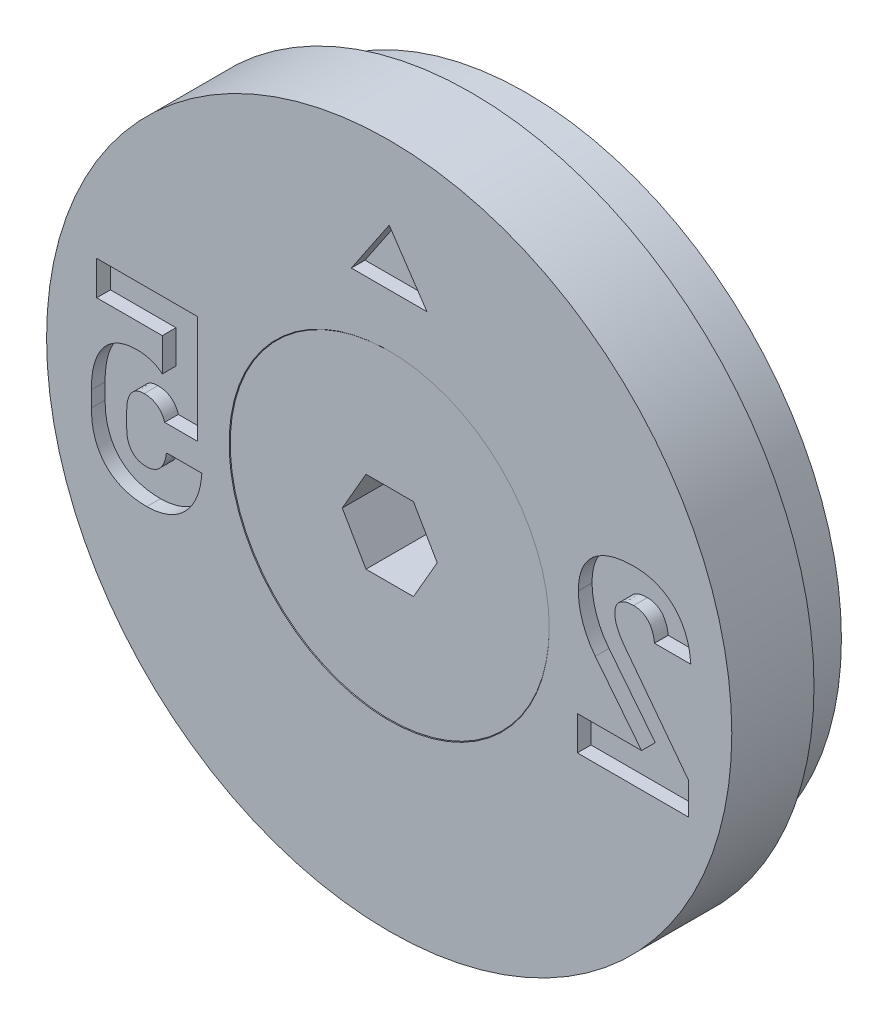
ISO-10303-21;
HEADER;
FILE_DESCRIPTION(('STEP AP214'),'2;1');
FILE_NAME('part.step','',(''),(''),'','','');
FILE_SCHEMA(('AUTOMOTIVE_DESIGN { 1 0 10303 214 1 1 1 1 }'));
ENDSEC;
DATA;
#1=APPLICATION_CONTEXT('core data for automotive mechanical design processes');
#2=APPLICATION_PROTOCOL_DEFINITION('international standard','automotive_design',2000,#1);
#3=PRODUCT_CONTEXT('',#1,'mechanical');
#4=PRODUCT('Part','Part','',(#3));
#5=PRODUCT_RELATED_PRODUCT_CATEGORY('part','',(#4));
#6=PRODUCT_DEFINITION_FORMATION('','',#4);
#7=PRODUCT_DEFINITION_CONTEXT('part definition',#1,'design');
#8=PRODUCT_DEFINITION('design','',#6,#7);
#9=PRODUCT_DEFINITION_SHAPE('','',#8);
#10=(LENGTH_UNIT() NAMED_UNIT(*) SI_UNIT(.MILLI.,.METRE.));
#11=(NAMED_UNIT(*) PLANE_ANGLE_UNIT() SI_UNIT($,.RADIAN.));
#12=(NAMED_UNIT(*) SI_UNIT($,.STERADIAN.) SOLID_ANGLE_UNIT());
#13=UNCERTAINTY_MEASURE_WITH_UNIT(LENGTH_MEASURE(1.E-05),#10,'distance_accuracy_value','');
#14=(GEOMETRIC_REPRESENTATION_CONTEXT(3) GLOBAL_UNCERTAINTY_ASSIGNED_CONTEXT((#13)) GLOBAL_UNIT_ASSIGNED_CONTEXT((#10,
#11,#12)) REPRESENTATION_CONTEXT('',''));
#15=CARTESIAN_POINT('',(0.,0.,0.));
#16=DIRECTION('',(0.,0.,1.));
#17=DIRECTION('',(1.,0.,0.));
#18=AXIS2_PLACEMENT_3D('',#15,#16,#17);
#19=CARTESIAN_POINT('',(0.,0.,-0.0200000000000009));
#20=DIRECTION('',(0.,0.,1.));
#21=DIRECTION('',(1.,0.,0.));
#22=AXIS2_PLACEMENT_3D('',#19,#20,#21);
#23=CYLINDRICAL_SURFACE('',#22,2.5);
#24=CARTESIAN_POINT('',(0.,0.,-3.34));
#25=DIRECTION('',(0.,0.,1.));
#26=DIRECTION('',(1.,0.,0.));
#27=AXIS2_PLACEMENT_3D('',#24,#25,#26);
#28=CIRCLE('',#27,2.5);
#29=CARTESIAN_POINT('',(2.5,0.,-3.34));
#30=VERTEX_POINT('',#29);
#31=EDGE_CURVE('E12',#30,#30,#28,.T.);
#32=ORIENTED_EDGE('',*,*,#31,.F.);
#33=EDGE_LOOP('',(#32));
#34=FACE_BOUND('',#33,.T.);
#35=CARTESIAN_POINT('',(0.,0.,-9.77));
#36=DIRECTION('',(0.,0.,1.));
#37=DIRECTION('',(1.,0.,0.));
#38=AXIS2_PLACEMENT_3D('',#35,#36,#37);
#39=CIRCLE('',#38,2.5);
#40=CARTESIAN_POINT('',(2.5,0.,-9.77));
#41=VERTEX_POINT('',#40);
#42=EDGE_CURVE('E146',#41,#41,#39,.T.);
#43=ORIENTED_EDGE('',*,*,#42,.T.);
#44=EDGE_LOOP('',(#43));
#45=FACE_BOUND('',#44,.T.);
#46=ADVANCED_FACE('F45',(#34,#45),#23,.T.);
#47=CARTESIAN_POINT('',(0.,0.,-3.34));
#48=DIRECTION('',(0.,0.,1.));
#49=DIRECTION('',(1.,0.,0.));
#50=AXIS2_PLACEMENT_3D('',#47,#48,#49);
#51=CONICAL_SURFACE('',#50,2.5,0.785398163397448);
#52=CARTESIAN_POINT('',(0.,0.,-0.0200000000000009));
#53=DIRECTION('',(0.,0.,1.));
#54=DIRECTION('',(1.,0.,0.));
#55=AXIS2_PLACEMENT_3D('',#52,#53,#54);
#56=CIRCLE('',#55,5.82);
#57=CARTESIAN_POINT('',(5.82,0.,-0.0200000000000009));
#58=VERTEX_POINT('',#57);
#59=EDGE_CURVE('E52',#58,#58,#56,.T.);
#60=ORIENTED_EDGE('',*,*,#59,.F.);
#61=EDGE_LOOP('',(#60));
#62=FACE_BOUND('',#61,.T.);
#63=ORIENTED_EDGE('',*,*,#31,.T.);
#64=EDGE_LOOP('',(#63));
#65=FACE_BOUND('',#64,.T.);
#66=ADVANCED_FACE('F161',(#62,#65),#51,.T.);
#67=CARTESIAN_POINT('',(0.,5.82,-0.0200000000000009));
#68=DIRECTION('',(0.,0.,-1.));
#69=DIRECTION('',(-1.,0.,0.));
#70=AXIS2_PLACEMENT_3D('',#67,#68,#69);
#71=PLANE('',#70);
#72=DIRECTION('',(1.,0.,0.));
#73=VECTOR('',#72,1.);
#74=CARTESIAN_POINT('',(-0.866025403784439,-1.5,-0.0200000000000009));
#75=LINE('',#74,#73);
#76=CARTESIAN_POINT('',(-0.866025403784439,-1.5,-0.0200000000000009));
#77=VERTEX_POINT('',#76);
#78=CARTESIAN_POINT('',(0.866025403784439,-1.5,-0.0200000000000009));
#79=VERTEX_POINT('',#78);
#80=EDGE_CURVE('E133',#77,#79,#75,.T.);
#81=ORIENTED_EDGE('',*,*,#80,.F.);
#82=DIRECTION('',(0.5,-0.866025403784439,0.));
#83=VECTOR('',#82,1.);
#84=CARTESIAN_POINT('',(-1.73205080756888,0.,-0.0200000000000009));
#85=LINE('',#84,#83);
#86=CARTESIAN_POINT('',(-1.73205080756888,0.,-0.0200000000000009));
#87=VERTEX_POINT('',#86);
#88=EDGE_CURVE('E59',#87,#77,#85,.T.);
#89=ORIENTED_EDGE('',*,*,#88,.F.);
#90=DIRECTION('',(-0.5,-0.866025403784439,0.));
#91=VECTOR('',#90,1.);
#92=CARTESIAN_POINT('',(-0.866025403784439,1.5,-0.0200000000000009));
#93=LINE('',#92,#91);
#94=CARTESIAN_POINT('',(-0.866025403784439,1.5,-0.0200000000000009));
#95=VERTEX_POINT('',#94);
#96=EDGE_CURVE('E142',#95,#87,#93,.T.);
#97=ORIENTED_EDGE('',*,*,#96,.F.);
#98=DIRECTION('',(-1.,0.,0.));
#99=VECTOR('',#98,1.);
#100=CARTESIAN_POINT('',(0.866025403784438,1.5,-0.0200000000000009));
#101=LINE('',#100,#99);
#102=CARTESIAN_POINT('',(0.866025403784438,1.5,-0.0200000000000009));
#103=VERTEX_POINT('',#102);
#104=EDGE_CURVE('E140',#103,#95,#101,.T.);
#105=ORIENTED_EDGE('',*,*,#104,.F.);
#106=DIRECTION('',(-0.5,0.866025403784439,0.));
#107=VECTOR('',#106,1.);
#108=CARTESIAN_POINT('',(1.73205080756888,0.,-0.0200000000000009));
#109=LINE('',#108,#107);
#110=CARTESIAN_POINT('',(1.73205080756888,0.,-0.0200000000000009));
#111=VERTEX_POINT('',#110);
#112=EDGE_CURVE('E107',#111,#103,#109,.T.);
#113=ORIENTED_EDGE('',*,*,#112,.F.);
#114=DIRECTION('',(0.5,0.866025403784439,0.));
#115=VECTOR('',#114,1.);
#116=CARTESIAN_POINT('',(0.866025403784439,-1.5,-0.0200000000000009));
#117=LINE('',#116,#115);
#118=EDGE_CURVE('E136',#79,#111,#117,.T.);
#119=ORIENTED_EDGE('',*,*,#118,.F.);
#120=EDGE_LOOP('',(#81,#89,#97,#105,#113,#119));
#121=FACE_BOUND('',#120,.T.);
#122=ORIENTED_EDGE('',*,*,#59,.T.);
#123=EDGE_LOOP('',(#122));
#124=FACE_BOUND('',#123,.T.);
#125=ADVANCED_FACE('F159',(#121,#124),#71,.F.);
#126=CARTESIAN_POINT('',(0.,0.,-10.02));
#127=DIRECTION('',(0.,0.,1.));
#128=DIRECTION('',(1.,0.,0.));
#129=AXIS2_PLACEMENT_3D('',#126,#127,#128);
#130=PLANE('',#129);
#131=CARTESIAN_POINT('',(0.,0.,-10.02));
#132=DIRECTION('',(0.,0.,1.));
#133=DIRECTION('',(1.,0.,0.));
#134=AXIS2_PLACEMENT_3D('',#131,#132,#133);
#135=CIRCLE('',#134,2.25);
#136=CARTESIAN_POINT('',(2.25,0.,-10.02));
#137=VERTEX_POINT('',#136);
#138=EDGE_CURVE('E154',#137,#137,#135,.T.);
#139=ORIENTED_EDGE('',*,*,#138,.F.);
#140=EDGE_LOOP('',(#139));
#141=FACE_BOUND('',#140,.T.);
#142=ADVANCED_FACE('F174',(#141),#130,.F.);
#143=CARTESIAN_POINT('',(0.,0.,-10.02));
#144=DIRECTION('',(0.,0.,1.));
#145=DIRECTION('',(1.,0.,0.));
#146=AXIS2_PLACEMENT_3D('',#143,#144,#145);
#147=CONICAL_SURFACE('',#146,2.25,0.78539816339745);
#148=ORIENTED_EDGE('',*,*,#42,.F.);
#149=EDGE_LOOP('',(#148));
#150=FACE_BOUND('',#149,.T.);
#151=ORIENTED_EDGE('',*,*,#138,.T.);
#152=EDGE_LOOP('',(#151));
#153=FACE_BOUND('',#152,.T.);
#154=ADVANCED_FACE('F170',(#150,#153),#147,.T.);
#155=CARTESIAN_POINT('',(-1.73205080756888,0.,-2.52));
#156=DIRECTION('',(-0.866025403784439,-0.5,0.));
#157=DIRECTION('',(0.5,-0.866025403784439,0.));
#158=AXIS2_PLACEMENT_3D('',#155,#156,#157);
#159=PLANE('',#158);
#160=ORIENTED_EDGE('',*,*,#88,.T.);
#161=DIRECTION('',(0.,0.,1.));
#162=VECTOR('',#161,1.);
#163=CARTESIAN_POINT('',(-0.866025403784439,-1.5,-2.52));
#164=LINE('',#163,#162);
#165=CARTESIAN_POINT('',(-0.866025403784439,-1.5,-2.52));
#166=VERTEX_POINT('',#165);
#167=EDGE_CURVE('E89',#166,#77,#164,.T.);
#168=ORIENTED_EDGE('',*,*,#167,.F.);
#169=DIRECTION('',(0.5,-0.866025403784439,0.));
#170=VECTOR('',#169,1.);
#171=CARTESIAN_POINT('',(-1.73205080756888,0.,-2.52));
#172=LINE('',#171,#170);
#173=CARTESIAN_POINT('',(-1.73205080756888,0.,-2.52));
#174=VERTEX_POINT('',#173);
#175=EDGE_CURVE('E144',#174,#166,#172,.T.);
#176=ORIENTED_EDGE('',*,*,#175,.F.);
#177=DIRECTION('',(0.,0.,1.));
#178=VECTOR('',#177,1.);
#179=CARTESIAN_POINT('',(-1.73205080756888,0.,-2.52));
#180=LINE('',#179,#178);
#181=EDGE_CURVE('E67',#174,#87,#180,.T.);
#182=ORIENTED_EDGE('',*,*,#181,.T.);
#183=EDGE_LOOP('',(#160,#168,#176,#182));
#184=FACE_BOUND('',#183,.T.);
#185=ADVANCED_FACE('F173',(#184),#159,.F.);
#186=CARTESIAN_POINT('',(-0.866025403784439,1.5,-2.52));
#187=DIRECTION('',(-0.866025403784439,0.5,0.));
#188=DIRECTION('',(-0.5,-0.866025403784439,0.));
#189=AXIS2_PLACEMENT_3D('',#186,#187,#188);
#190=PLANE('',#189);
#191=ORIENTED_EDGE('',*,*,#96,.T.);
#192=ORIENTED_EDGE('',*,*,#181,.F.);
#193=DIRECTION('',(-0.5,-0.866025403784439,0.));
#194=VECTOR('',#193,1.);
#195=CARTESIAN_POINT('',(-0.866025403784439,1.5,-2.52));
#196=LINE('',#195,#194);
#197=CARTESIAN_POINT('',(-0.866025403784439,1.5,-2.52));
#198=VERTEX_POINT('',#197);
#199=EDGE_CURVE('E119',#198,#174,#196,.T.);
#200=ORIENTED_EDGE('',*,*,#199,.F.);
#201=DIRECTION('',(0.,0.,1.));
#202=VECTOR('',#201,1.);
#203=CARTESIAN_POINT('',(-0.866025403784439,1.5,-2.52));
#204=LINE('',#203,#202);
#205=EDGE_CURVE('E111',#198,#95,#204,.T.);
#206=ORIENTED_EDGE('',*,*,#205,.T.);
#207=EDGE_LOOP('',(#191,#192,#200,#206));
#208=FACE_BOUND('',#207,.T.);
#209=ADVANCED_FACE('F189',(#208),#190,.F.);
#210=CARTESIAN_POINT('',(0.866025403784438,1.5,-2.52));
#211=DIRECTION('',(0.,1.,0.));
#212=DIRECTION('',(-1.,0.,0.));
#213=AXIS2_PLACEMENT_3D('',#210,#211,#212);
#214=PLANE('',#213);
#215=ORIENTED_EDGE('',*,*,#104,.T.);
#216=ORIENTED_EDGE('',*,*,#205,.F.);
#217=DIRECTION('',(-1.,0.,0.));
#218=VECTOR('',#217,1.);
#219=CARTESIAN_POINT('',(0.866025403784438,1.5,-2.52));
#220=LINE('',#219,#218);
#221=CARTESIAN_POINT('',(0.866025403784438,1.5,-2.52));
#222=VERTEX_POINT('',#221);
#223=EDGE_CURVE('E115',#222,#198,#220,.T.);
#224=ORIENTED_EDGE('',*,*,#223,.F.);
#225=DIRECTION('',(0.,0.,1.));
#226=VECTOR('',#225,1.);
#227=CARTESIAN_POINT('',(0.866025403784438,1.5,-2.52));
#228=LINE('',#227,#226);
#229=EDGE_CURVE('E100',#222,#103,#228,.T.);
#230=ORIENTED_EDGE('',*,*,#229,.T.);
#231=EDGE_LOOP('',(#215,#216,#224,#230));
#232=FACE_BOUND('',#231,.T.);
#233=ADVANCED_FACE('F116',(#232),#214,.F.);
#234=CARTESIAN_POINT('',(1.73205080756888,0.,-2.52));
#235=DIRECTION('',(0.866025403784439,0.5,0.));
#236=DIRECTION('',(-0.5,0.866025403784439,0.));
#237=AXIS2_PLACEMENT_3D('',#234,#235,#236);
#238=PLANE('',#237);
#239=ORIENTED_EDGE('',*,*,#112,.T.);
#240=ORIENTED_EDGE('',*,*,#229,.F.);
#241=DIRECTION('',(-0.5,0.866025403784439,0.));
#242=VECTOR('',#241,1.);
#243=CARTESIAN_POINT('',(1.73205080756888,0.,-2.52));
#244=LINE('',#243,#242);
#245=CARTESIAN_POINT('',(1.73205080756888,0.,-2.52));
#246=VERTEX_POINT('',#245);
#247=EDGE_CURVE('E104',#246,#222,#244,.T.);
#248=ORIENTED_EDGE('',*,*,#247,.F.);
#249=DIRECTION('',(0.,0.,1.));
#250=VECTOR('',#249,1.);
#251=CARTESIAN_POINT('',(1.73205080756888,0.,-2.52));
#252=LINE('',#251,#250);
#253=EDGE_CURVE('E112',#246,#111,#252,.T.);
#254=ORIENTED_EDGE('',*,*,#253,.T.);
#255=EDGE_LOOP('',(#239,#240,#248,#254));
#256=FACE_BOUND('',#255,.T.);
#257=ADVANCED_FACE('F102',(#256),#238,.F.);
#258=CARTESIAN_POINT('',(0.866025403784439,-1.5,-2.52));
#259=DIRECTION('',(0.866025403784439,-0.5,0.));
#260=DIRECTION('',(0.5,0.866025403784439,0.));
#261=AXIS2_PLACEMENT_3D('',#258,#259,#260);
#262=PLANE('',#261);
#263=ORIENTED_EDGE('',*,*,#118,.T.);
#264=ORIENTED_EDGE('',*,*,#253,.F.);
#265=DIRECTION('',(0.5,0.866025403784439,0.));
#266=VECTOR('',#265,1.);
#267=CARTESIAN_POINT('',(0.866025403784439,-1.5,-2.52));
#268=LINE('',#267,#266);
#269=CARTESIAN_POINT('',(0.866025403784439,-1.5,-2.52));
#270=VERTEX_POINT('',#269);
#271=EDGE_CURVE('E125',#270,#246,#268,.T.);
#272=ORIENTED_EDGE('',*,*,#271,.F.);
#273=DIRECTION('',(0.,0.,1.));
#274=VECTOR('',#273,1.);
#275=CARTESIAN_POINT('',(0.866025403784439,-1.5,-2.52));
#276=LINE('',#275,#274);
#277=EDGE_CURVE('E149',#270,#79,#276,.T.);
#278=ORIENTED_EDGE('',*,*,#277,.T.);
#279=EDGE_LOOP('',(#263,#264,#272,#278));
#280=FACE_BOUND('',#279,.T.);
#281=ADVANCED_FACE('F193',(#280),#262,.F.);
#282=CARTESIAN_POINT('',(-0.866025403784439,-1.5,-2.52));
#283=DIRECTION('',(0.,-1.,0.));
#284=DIRECTION('',(0.,0.,-1.));
#285=AXIS2_PLACEMENT_3D('',#282,#283,#284);
#286=PLANE('',#285);
#287=ORIENTED_EDGE('',*,*,#80,.T.);
#288=ORIENTED_EDGE('',*,*,#277,.F.);
#289=DIRECTION('',(1.,0.,0.));
#290=VECTOR('',#289,1.);
#291=CARTESIAN_POINT('',(-0.866025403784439,-1.5,-2.52));
#292=LINE('',#291,#290);
#293=EDGE_CURVE('E127',#166,#270,#292,.T.);
#294=ORIENTED_EDGE('',*,*,#293,.F.);
#295=ORIENTED_EDGE('',*,*,#167,.T.);
#296=EDGE_LOOP('',(#287,#288,#294,#295));
#297=FACE_BOUND('',#296,.T.);
#298=ADVANCED_FACE('F190',(#297),#286,.F.);
#299=CARTESIAN_POINT('',(0.,0.,-2.52));
#300=DIRECTION('',(0.,0.,1.));
#301=DIRECTION('',(1.,0.,0.));
#302=AXIS2_PLACEMENT_3D('',#299,#300,#301);
#303=PLANE('',#302);
#304=ORIENTED_EDGE('',*,*,#175,.T.);
#305=ORIENTED_EDGE('',*,*,#293,.T.);
#306=ORIENTED_EDGE('',*,*,#271,.T.);
#307=ORIENTED_EDGE('',*,*,#247,.T.);
#308=ORIENTED_EDGE('',*,*,#223,.T.);
#309=ORIENTED_EDGE('',*,*,#199,.T.);
#310=EDGE_LOOP('',(#304,#305,#306,#307,#308,#309));
#311=FACE_BOUND('',#310,.T.);
#312=ADVANCED_FACE('F122',(#311),#303,.T.);
#313=CLOSED_SHELL('',(#46,#66,#125,#142,#154,#185,#209,#233,#257,#281,#298,#312));
#314=MANIFOLD_SOLID_BREP('B2',#313);
#315=CARTESIAN_POINT('',(0.,0.,3.12219627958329));
#316=DIRECTION('',(0.,0.,1.));
#317=DIRECTION('',(1.,0.,0.));
#318=AXIS2_PLACEMENT_3D('',#315,#316,#317);
#319=CYLINDRICAL_SURFACE('',#318,12.5);
#320=CARTESIAN_POINT('',(0.,0.,0.));
#321=DIRECTION('',(0.,0.,1.));
#322=DIRECTION('',(1.,0.,0.));
#323=AXIS2_PLACEMENT_3D('',#320,#321,#322);
#324=CIRCLE('',#323,12.5);
#325=CARTESIAN_POINT('',(12.5,0.,0.));
#326=VERTEX_POINT('',#325);
#327=EDGE_CURVE('E43',#326,#326,#324,.T.);
#328=ORIENTED_EDGE('',*,*,#327,.F.);
#329=EDGE_LOOP('',(#328));
#330=FACE_BOUND('',#329,.T.);
#331=CARTESIAN_POINT('',(0.,0.,-3.));
#332=DIRECTION('',(0.,0.,1.));
#333=DIRECTION('',(1.,0.,0.));
#334=AXIS2_PLACEMENT_3D('',#331,#332,#333);
#335=CIRCLE('',#334,12.5);
#336=CARTESIAN_POINT('',(12.5,0.,-3.));
#337=VERTEX_POINT('',#336);
#338=EDGE_CURVE('E745',#337,#337,#335,.T.);
#339=ORIENTED_EDGE('',*,*,#338,.T.);
#340=EDGE_LOOP('',(#339));
#341=FACE_BOUND('',#340,.T.);
#342=ADVANCED_FACE('F256',(#330,#341),#319,.T.);
#343=CARTESIAN_POINT('',(0.,12.5,0.));
#344=DIRECTION('',(0.,0.,-1.));
#345=DIRECTION('',(-1.,0.,0.));
#346=AXIS2_PLACEMENT_3D('',#343,#344,#345);
#347=PLANE('',#346);
#348=DIRECTION('',(-0.60539313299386,0.795926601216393,0.));
#349=VECTOR('',#348,1.);
#350=CARTESIAN_POINT('',(10.919877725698,-2.26340554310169,0.));
#351=LINE('',#350,#349);
#352=CARTESIAN_POINT('',(10.919877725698,-2.26340554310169,0.));
#353=VERTEX_POINT('',#352);
#354=CARTESIAN_POINT('',(8.5663272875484,0.830870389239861,0.));
#355=VERTEX_POINT('',#354);
#356=EDGE_CURVE('E1207',#353,#355,#351,.T.);
#357=ORIENTED_EDGE('',*,*,#356,.F.);
#358=DIRECTION('',(0.,1.,0.));
#359=VECTOR('',#358,1.);
#360=CARTESIAN_POINT('',(10.919877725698,-3.429,0.));
#361=LINE('',#360,#359);
#362=CARTESIAN_POINT('',(10.919877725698,-3.429,0.));
#363=VERTEX_POINT('',#362);
#364=EDGE_CURVE('E270',#363,#353,#361,.T.);
#365=ORIENTED_EDGE('',*,*,#364,.F.);
#366=DIRECTION('',(1.,0.,0.));
#367=VECTOR('',#366,1.);
#368=CARTESIAN_POINT('',(6.86405624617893,-3.429,0.));
#369=LINE('',#368,#367);
#370=CARTESIAN_POINT('',(6.86405624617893,-3.429,0.));
#371=VERTEX_POINT('',#370);
#372=EDGE_CURVE('E527',#371,#363,#369,.T.);
#373=ORIENTED_EDGE('',*,*,#372,.F.);
#374=DIRECTION('',(0.,-1.,0.));
#375=VECTOR('',#374,1.);
#376=CARTESIAN_POINT('',(6.86405624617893,-2.18374261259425,0.));
#377=LINE('',#376,#375);
#378=CARTESIAN_POINT('',(6.86405624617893,-2.18374261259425,0.));
#379=VERTEX_POINT('',#378);
#380=EDGE_CURVE('E530',#379,#371,#377,.T.);
#381=ORIENTED_EDGE('',*,*,#380,.F.);
#382=DIRECTION('',(-1.,0.,0.));
#383=VECTOR('',#382,1.);
#384=CARTESIAN_POINT('',(9.20782351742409,-2.18374261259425,0.));
#385=LINE('',#384,#383);
#386=CARTESIAN_POINT('',(9.20782351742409,-2.18374261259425,0.));
#387=VERTEX_POINT('',#386);
#388=EDGE_CURVE('E1275',#387,#379,#385,.T.);
#389=ORIENTED_EDGE('',*,*,#388,.F.);
#390=DIRECTION('',(0.620676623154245,-0.78406666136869,0.));
#391=VECTOR('',#390,1.);
#392=CARTESIAN_POINT('',(7.51952842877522,-0.0510122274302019,0.));
#393=LINE('',#392,#391);
#394=CARTESIAN_POINT('',(7.51952842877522,-0.0510122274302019,0.));
#395=VERTEX_POINT('',#394);
#396=EDGE_CURVE('E1269',#395,#387,#393,.T.);
#397=ORIENTED_EDGE('',*,*,#396,.F.);
#398=CARTESIAN_POINT('',(6.90179131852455,1.70716262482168,0.));
#399=CARTESIAN_POINT('',(6.90358309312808,1.62926486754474,0.));
#400=CARTESIAN_POINT('',(6.90716991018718,1.47332728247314,0.));
#401=CARTESIAN_POINT('',(6.93915967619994,1.24036145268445,0.));
#402=CARTESIAN_POINT('',(6.99146768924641,1.00874165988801,0.));
#403=CARTESIAN_POINT('',(7.06244262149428,0.779279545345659,0.));
#404=CARTESIAN_POINT('',(7.15107066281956,0.555806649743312,0.));
#405=CARTESIAN_POINT('',(7.25684213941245,0.341884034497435,0.));
#406=CARTESIAN_POINT('',(7.37760123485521,0.138057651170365,0.));
#407=CARTESIAN_POINT('',(7.47222598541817,0.012002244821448,0.));
#408=CARTESIAN_POINT('',(7.51952842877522,-0.0510122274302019,0.));
#409=B_SPLINE_CURVE_WITH_KNOTS('',3,(#398,#399,#400,#401,#402,#403,#404,#405,#406,#407,#408),
.UNSPECIFIED.,.F.,.F.,(4,1,1,1,1,1,1,1,4),(0.,0.123148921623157,0.246522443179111,
0.371108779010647,0.498350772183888,0.625999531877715,0.750879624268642,0.875465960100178,1.),.UNSPECIFIED.);
#410=CARTESIAN_POINT('',(6.90179131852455,1.70716262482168,0.));
#411=VERTEX_POINT('',#410);
#412=EDGE_CURVE('E1264',#411,#395,#409,.T.);
#413=ORIENTED_EDGE('',*,*,#412,.F.);
#414=DIRECTION('',(0.,-1.,0.));
#415=VECTOR('',#414,1.);
#416=CARTESIAN_POINT('',(6.90179131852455,1.71275300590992,0.));
#417=LINE('',#416,#415);
#418=CARTESIAN_POINT('',(6.90179131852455,1.71275300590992,0.));
#419=VERTEX_POINT('',#418);
#420=EDGE_CURVE('E1258',#419,#411,#417,.T.);
#421=ORIENTED_EDGE('',*,*,#420,.F.);
#422=CARTESIAN_POINT('',(8.92970205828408,3.50027735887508,0.));
#423=CARTESIAN_POINT('',(8.82661758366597,3.49812235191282,0.));
#424=CARTESIAN_POINT('',(8.62710387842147,3.49395146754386,0.));
#425=CARTESIAN_POINT('',(8.33981754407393,3.45468735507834,0.));
#426=CARTESIAN_POINT('',(8.07565279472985,3.38934736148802,0.));
#427=CARTESIAN_POINT('',(7.83527235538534,3.29754724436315,0.));
#428=CARTESIAN_POINT('',(7.62025469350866,3.17954043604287,0.));
#429=CARTESIAN_POINT('',(7.42960469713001,3.03946832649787,0.));
#430=CARTESIAN_POINT('',(7.26870532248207,2.87189330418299,0.));
#431=CARTESIAN_POINT('',(7.13486880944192,2.68152557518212,0.));
#432=CARTESIAN_POINT('',(7.0293646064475,2.46909971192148,0.));
#433=CARTESIAN_POINT('',(6.9554803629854,2.2347989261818,0.));
#434=CARTESIAN_POINT('',(6.91023317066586,1.98050526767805,0.));
#435=CARTESIAN_POINT('',(6.90466161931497,1.80379102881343,0.));
#436=CARTESIAN_POINT('',(6.90179131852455,1.71275300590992,0.));
#437=B_SPLINE_CURVE_WITH_KNOTS('',3,(#422,#423,#424,#425,#426,#427,#428,#429,#430,#431,#432,
#433,#434,#435,#436),.UNSPECIFIED.,.F.,.F.,(4,1,1,1,1,1,1,1,1,1,1,1,4),(0.,0.100715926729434,
0.194929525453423,0.282728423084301,0.366191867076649,0.44566981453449,0.521804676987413,
0.596515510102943,0.67168287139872,0.748455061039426,0.827368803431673,0.911065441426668,1.),.UNSPECIFIED.);
#438=CARTESIAN_POINT('',(8.92970205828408,3.50027735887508,0.));
#439=VERTEX_POINT('',#438);
#440=EDGE_CURVE('E1250',#439,#419,#437,.T.);
#441=ORIENTED_EDGE('',*,*,#440,.F.);
#442=CARTESIAN_POINT('',(11.0051310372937,1.44860749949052,0.));
#443=CARTESIAN_POINT('',(10.9956378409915,1.55185335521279,0.));
#444=CARTESIAN_POINT('',(10.9771445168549,1.75298256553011,0.));
#445=CARTESIAN_POINT('',(10.9142619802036,2.04222247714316,0.));
#446=CARTESIAN_POINT('',(10.8213662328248,2.30836659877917,0.));
#447=CARTESIAN_POINT('',(10.7026790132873,2.55214952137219,0.));
#448=CARTESIAN_POINT('',(10.5571477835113,2.77049371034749,0.));
#449=CARTESIAN_POINT('',(10.3882882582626,2.96334030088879,0.));
#450=CARTESIAN_POINT('',(10.1942302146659,3.12694348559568,0.));
#451=CARTESIAN_POINT('',(9.97833500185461,3.26289145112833,0.));
#452=CARTESIAN_POINT('',(9.74154560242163,3.36928450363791,0.));
#453=CARTESIAN_POINT('',(9.48675783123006,3.44680341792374,0.));
#454=CARTESIAN_POINT('',(9.21358795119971,3.49149220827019,0.));
#455=CARTESIAN_POINT('',(9.02583304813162,3.49730248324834,0.));
#456=CARTESIAN_POINT('',(8.92970205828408,3.50027735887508,0.));
#457=B_SPLINE_CURVE_WITH_KNOTS('',3,(#442,#443,#444,#445,#446,#447,#448,#449,#450,#451,#452,
#453,#454,#455,#456),.UNSPECIFIED.,.F.,.F.,(4,1,1,1,1,1,1,1,1,1,1,1,4),(0.,0.0953291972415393,
0.185707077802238,0.271513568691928,0.35413169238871,0.434493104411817,0.512233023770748,
0.58917600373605,0.667186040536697,0.746219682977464,0.827302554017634,0.911578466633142,1.),.UNSPECIFIED.);
#458=CARTESIAN_POINT('',(11.0051310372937,1.44860749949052,0.));
#459=VERTEX_POINT('',#458);
#460=EDGE_CURVE('E1245',#459,#439,#457,.T.);
#461=ORIENTED_EDGE('',*,*,#460,.F.);
#462=DIRECTION('',(0.,1.,0.));
#463=VECTOR('',#462,1.);
#464=CARTESIAN_POINT('',(11.0051310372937,1.44301711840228,0.));
#465=LINE('',#464,#463);
#466=CARTESIAN_POINT('',(11.0051310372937,1.44301711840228,0.));
#467=VERTEX_POINT('',#466);
#468=EDGE_CURVE('E1242',#467,#459,#465,.T.);
#469=ORIENTED_EDGE('',*,*,#468,.F.);
#470=DIRECTION('',(1.,0.,0.));
#471=VECTOR('',#470,1.);
#472=CARTESIAN_POINT('',(9.68021071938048,1.44301711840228,0.));
#473=LINE('',#472,#471);
#474=CARTESIAN_POINT('',(9.68021071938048,1.44301711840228,0.));
#475=VERTEX_POINT('',#474);
#476=EDGE_CURVE('E1239',#475,#467,#473,.T.);
#477=ORIENTED_EDGE('',*,*,#476,.F.);
#478=DIRECTION('',(0.,-1.,0.));
#479=VECTOR('',#478,1.);
#480=CARTESIAN_POINT('',(9.68021071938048,1.44860749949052,0.));
#481=LINE('',#480,#479);
#482=CARTESIAN_POINT('',(9.68021071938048,1.44860749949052,0.));
#483=VERTEX_POINT('',#482);
#484=EDGE_CURVE('E1233',#483,#475,#481,.T.);
#485=ORIENTED_EDGE('',*,*,#484,.F.);
#486=CARTESIAN_POINT('',(8.91991889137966,2.25501997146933,0.));
#487=CARTESIAN_POINT('',(8.97095753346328,2.25286405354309,0.));
#488=CARTESIAN_POINT('',(9.07000738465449,2.24868009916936,0.));
#489=CARTESIAN_POINT('',(9.21090652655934,2.20881121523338,0.));
#490=CARTESIAN_POINT('',(9.33607200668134,2.14112528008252,0.));
#491=CARTESIAN_POINT('',(9.44442297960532,2.04758170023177,0.));
#492=CARTESIAN_POINT('',(9.53533926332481,1.92990369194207,0.));
#493=CARTESIAN_POINT('',(9.60235132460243,1.78814002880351,0.));
#494=CARTESIAN_POINT('',(9.65631723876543,1.6270195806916,0.));
#495=CARTESIAN_POINT('',(9.67197806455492,1.51008054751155,0.));
#496=CARTESIAN_POINT('',(9.68021071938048,1.44860749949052,0.));
#497=B_SPLINE_CURVE_WITH_KNOTS('',3,(#486,#487,#488,#489,#490,#491,#492,#493,#494,#495,#496),
.UNSPECIFIED.,.F.,.F.,(4,1,1,1,1,1,1,1,4),(0.,0.124212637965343,0.241057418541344,
0.353359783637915,0.468536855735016,0.587568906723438,0.713021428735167,0.849139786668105,1.),.UNSPECIFIED.);
#498=CARTESIAN_POINT('',(8.91991889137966,2.25501997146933,0.));
#499=VERTEX_POINT('',#498);
#500=EDGE_CURVE('E1225',#499,#483,#497,.T.);
#501=ORIENTED_EDGE('',*,*,#500,.F.);
#502=CARTESIAN_POINT('',(8.23230201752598,1.6750179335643,0.));
#503=CARTESIAN_POINT('',(8.2341776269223,1.71905514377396,0.));
#504=CARTESIAN_POINT('',(8.23775190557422,1.80297520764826,0.));
#505=CARTESIAN_POINT('',(8.27225832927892,1.9210421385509,0.));
#506=CARTESIAN_POINT('',(8.32931827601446,2.02313777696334,0.));
#507=CARTESIAN_POINT('',(8.40924379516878,2.10872287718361,0.));
#508=CARTESIAN_POINT('',(8.51090954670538,2.17449898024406,0.));
#509=CARTESIAN_POINT('',(8.63083074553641,2.22254791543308,0.));
#510=CARTESIAN_POINT('',(8.76964467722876,2.24973459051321,0.));
#511=CARTESIAN_POINT('',(8.86808758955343,2.25319698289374,0.));
#512=CARTESIAN_POINT('',(8.91991889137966,2.25501997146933,0.));
#513=B_SPLINE_CURVE_WITH_KNOTS('',3,(#502,#503,#504,#505,#506,#507,#508,#509,#510,#511,#512),
.UNSPECIFIED.,.F.,.F.,(4,1,1,1,1,1,1,1,4),(0.,0.129170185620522,0.246154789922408,
0.35773418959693,0.470108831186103,0.586692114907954,0.710769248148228,0.847716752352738,1.),.UNSPECIFIED.);
#514=CARTESIAN_POINT('',(8.23230201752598,1.6750179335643,0.));
#515=VERTEX_POINT('',#514);
#516=EDGE_CURVE('E1220',#515,#499,#513,.T.);
#517=ORIENTED_EDGE('',*,*,#516,.F.);
#518=DIRECTION('',(0.,1.,0.));
#519=VECTOR('',#518,1.);
#520=CARTESIAN_POINT('',(8.23230201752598,1.66523476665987,0.));
#521=LINE('',#520,#519);
#522=CARTESIAN_POINT('',(8.23230201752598,1.66523476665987,0.));
#523=VERTEX_POINT('',#522);
#524=EDGE_CURVE('E1214',#523,#515,#521,.T.);
#525=ORIENTED_EDGE('',*,*,#524,.F.);
#526=CARTESIAN_POINT('',(8.5663272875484,0.830870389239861,0.));
#527=CARTESIAN_POINT('',(8.51696694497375,0.899353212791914,0.));
#528=CARTESIAN_POINT('',(8.42060528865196,1.03304592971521,0.));
#529=CARTESIAN_POINT('',(8.33439138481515,1.21744558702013,0.));
#530=CARTESIAN_POINT('',(8.27962250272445,1.36203407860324,0.));
#531=CARTESIAN_POINT('',(8.25430169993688,1.46691616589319,0.));
#532=CARTESIAN_POINT('',(8.23555730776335,1.56720710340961,0.));
#533=CARTESIAN_POINT('',(8.23337219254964,1.63300822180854,0.));
#534=CARTESIAN_POINT('',(8.23230201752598,1.66523476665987,0.));
#535=B_SPLINE_CURVE_WITH_KNOTS('',3,(#526,#527,#528,#529,#530,#531,#532,#533,#534),
.UNSPECIFIED.,.F.,.F.,(4,1,1,1,1,1,4),(0.,0.27673722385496,0.540248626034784,0.66563356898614,
0.784034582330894,0.894229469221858,1.),.UNSPECIFIED.);
#536=EDGE_CURVE('E1209',#355,#523,#535,.T.);
#537=ORIENTED_EDGE('',*,*,#536,.F.);
#538=EDGE_LOOP('',(#357,#365,#373,#381,#389,#397,#413,#421,#441,#461,#469,#477,#485,#501,#517,
#525,#537));
#539=FACE_BOUND('',#538,.T.);
#540=CARTESIAN_POINT('',(-8.8445791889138,-3.50027735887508,0.));
#541=CARTESIAN_POINT('',(-8.75444457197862,-3.49752748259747,0.));
#542=CARTESIAN_POINT('',(-8.57806659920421,-3.49214644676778,0.));
#543=CARTESIAN_POINT('',(-8.32097022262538,-3.44383956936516,0.));
#544=CARTESIAN_POINT('',(-8.07723449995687,-3.36902762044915,0.));
#545=CARTESIAN_POINT('',(-7.8486718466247,-3.26230327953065,0.));
#546=CARTESIAN_POINT('',(-7.63776583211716,-3.12671318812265,0.));
#547=CARTESIAN_POINT('',(-7.44917915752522,-2.96090987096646,0.));
#548=CARTESIAN_POINT('',(-7.28118204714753,-2.76923434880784,0.));
#549=CARTESIAN_POINT('',(-7.13714326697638,-2.55000875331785,0.));
#550=CARTESIAN_POINT('',(-7.01852154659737,-2.30557833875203,0.));
#551=CARTESIAN_POINT('',(-6.92617246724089,-2.03882385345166,0.));
#552=CARTESIAN_POINT('',(-6.86274349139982,-1.75022480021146,0.));
#553=CARTESIAN_POINT('',(-6.84430367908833,-1.54999986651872,0.));
#554=CARTESIAN_POINT('',(-6.83483718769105,-1.44720990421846,0.));
#555=B_SPLINE_CURVE_WITH_KNOTS('',3,(#540,#541,#542,#543,#544,#545,#546,#547,#548,#549,#550,
#551,#552,#553,#554),.UNSPECIFIED.,.F.,.F.,(4,1,1,1,1,1,1,1,1,1,1,1,4),(0.,0.0844304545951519,
0.165215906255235,0.244369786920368,0.322918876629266,0.40093676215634,0.478631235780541,
0.557558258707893,0.63920335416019,0.723781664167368,0.811629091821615,0.903295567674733,1.),.UNSPECIFIED.);
#556=CARTESIAN_POINT('',(-8.8445791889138,-3.50027735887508,0.));
#557=VERTEX_POINT('',#556);
#558=CARTESIAN_POINT('',(-6.83483718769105,-1.44720990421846,0.));
#559=VERTEX_POINT('',#558);
#560=EDGE_CURVE('E594',#557,#559,#555,.T.);
#561=ORIENTED_EDGE('',*,*,#560,.F.);
#562=CARTESIAN_POINT('',(-10.8668995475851,-1.39549887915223,0.));
#563=CARTESIAN_POINT('',(-10.8638380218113,-1.50231014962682,0.));
#564=CARTESIAN_POINT('',(-10.8579154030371,-1.70893994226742,0.));
#565=CARTESIAN_POINT('',(-10.8155624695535,-2.00774148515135,0.));
#566=CARTESIAN_POINT('',(-10.739212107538,-2.28182951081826,0.));
#567=CARTESIAN_POINT('',(-10.636913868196,-2.53297602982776,0.));
#568=CARTESIAN_POINT('',(-10.5033336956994,-2.75619031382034,0.));
#569=CARTESIAN_POINT('',(-10.3433793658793,-2.95335794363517,0.));
#570=CARTESIAN_POINT('',(-10.154131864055,-3.11992654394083,0.));
#571=CARTESIAN_POINT('',(-9.940057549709,-3.26010810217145,0.));
#572=CARTESIAN_POINT('',(-9.69911950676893,-3.36761760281,0.));
#573=CARTESIAN_POINT('',(-9.43516793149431,-3.44571973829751,0.));
#574=CARTESIAN_POINT('',(-9.14715828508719,-3.49217525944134,0.));
#575=CARTESIAN_POINT('',(-8.94771051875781,-3.49751583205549,0.));
#576=CARTESIAN_POINT('',(-8.8445791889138,-3.50027735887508,0.));
#577=B_SPLINE_CURVE_WITH_KNOTS('',3,(#562,#563,#564,#565,#566,#567,#568,#569,#570,#571,#572,
#573,#574,#575,#576),.UNSPECIFIED.,.F.,.F.,(4,1,1,1,1,1,1,1,1,1,1,1,4),(0.,0.0965919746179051,
0.186860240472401,0.272108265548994,0.35332451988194,0.431359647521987,0.506505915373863,
0.582010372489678,0.658435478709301,0.737063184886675,0.819709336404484,0.906774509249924,1.),.UNSPECIFIED.);
#578=CARTESIAN_POINT('',(-10.8668995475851,-1.39549887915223,0.));
#579=VERTEX_POINT('',#578);
#580=EDGE_CURVE('E278',#579,#557,#577,.T.);
#581=ORIENTED_EDGE('',*,*,#580,.F.);
#582=DIRECTION('',(0.,-1.,0.));
#583=VECTOR('',#582,1.);
#584=CARTESIAN_POINT('',(-10.8668995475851,-0.821087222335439,0.));
#585=LINE('',#584,#583);
#586=CARTESIAN_POINT('',(-10.8668995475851,-0.821087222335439,0.));
#587=VERTEX_POINT('',#586);
#588=EDGE_CURVE('E680',#587,#579,#585,.T.);
#589=ORIENTED_EDGE('',*,*,#588,.F.);
#590=CARTESIAN_POINT('',(-9.17860445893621,1.27810087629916,0.));
#591=CARTESIAN_POINT('',(-9.26455457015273,1.27537967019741,0.));
#592=CARTESIAN_POINT('',(-9.43125326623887,1.27010193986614,0.));
#593=CARTESIAN_POINT('',(-9.67170256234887,1.22262751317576,0.));
#594=CARTESIAN_POINT('',(-9.89329892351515,1.14656864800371,0.));
#595=CARTESIAN_POINT('',(-10.0942138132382,1.03698984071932,0.));
#596=CARTESIAN_POINT('',(-10.2746744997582,0.89964940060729,0.));
#597=CARTESIAN_POINT('',(-10.4314182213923,0.731830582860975,0.));
#598=CARTESIAN_POINT('',(-10.5654221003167,0.536268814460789,0.));
#599=CARTESIAN_POINT('',(-10.6750927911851,0.312833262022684,0.));
#600=CARTESIAN_POINT('',(-10.7614082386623,0.0634818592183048,0.));
#601=CARTESIAN_POINT('',(-10.8241017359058,-0.210044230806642,0.));
#602=CARTESIAN_POINT('',(-10.8598293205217,-0.508010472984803,0.));
#603=CARTESIAN_POINT('',(-10.8644881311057,-0.714307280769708,0.));
#604=CARTESIAN_POINT('',(-10.8668995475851,-0.821087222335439,0.));
#605=B_SPLINE_CURVE_WITH_KNOTS('',3,(#590,#591,#592,#593,#594,#595,#596,#597,#598,#599,#600,
#601,#602,#603,#604),.UNSPECIFIED.,.F.,.F.,(4,1,1,1,1,1,1,1,1,1,1,1,4),(0.,0.0843949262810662,
0.163682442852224,0.239848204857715,0.313806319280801,0.387615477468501,0.461788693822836,
0.538496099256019,0.61978489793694,0.705652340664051,0.797279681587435,0.895071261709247,1.),.UNSPECIFIED.);
#606=CARTESIAN_POINT('',(-9.17860445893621,1.27810087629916,0.));
#607=VERTEX_POINT('',#606);
#608=EDGE_CURVE('E672',#607,#587,#605,.T.);
#609=ORIENTED_EDGE('',*,*,#608,.F.);
#610=CARTESIAN_POINT('',(-8.27855310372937,0.972027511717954,0.));
#611=CARTESIAN_POINT('',(-8.30457241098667,0.995066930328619,0.));
#612=CARTESIAN_POINT('',(-8.35809615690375,1.04246081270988,0.));
#613=CARTESIAN_POINT('',(-8.45167106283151,1.10263781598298,0.));
#614=CARTESIAN_POINT('',(-8.55869203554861,1.15374832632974,0.));
#615=CARTESIAN_POINT('',(-8.71661141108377,1.2126137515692,0.));
#616=CARTESIAN_POINT('',(-8.92434752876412,1.26495936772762,0.));
#617=CARTESIAN_POINT('',(-9.09488433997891,1.27377372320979,0.));
#618=CARTESIAN_POINT('',(-9.17860445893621,1.27810087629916,0.));
#619=B_SPLINE_CURVE_WITH_KNOTS('',3,(#610,#611,#612,#613,#614,#615,#616,#617,#618),
.UNSPECIFIED.,.F.,.F.,(4,1,1,1,1,1,4),(0.,0.107291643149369,0.22070728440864,0.342410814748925,
0.473179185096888,0.741372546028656,1.),.UNSPECIFIED.);
#620=CARTESIAN_POINT('',(-8.27855310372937,0.972027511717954,0.));
#621=VERTEX_POINT('',#620);
#622=EDGE_CURVE('E667',#621,#607,#619,.T.);
#623=ORIENTED_EDGE('',*,*,#622,.F.);
#624=DIRECTION('',(0.,-1.,0.));
#625=VECTOR('',#624,1.);
#626=CARTESIAN_POINT('',(-8.27855310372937,2.18374261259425,0.));
#627=LINE('',#626,#625);
#628=CARTESIAN_POINT('',(-8.27855310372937,2.18374261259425,0.));
#629=VERTEX_POINT('',#628);
#630=EDGE_CURVE('E664',#629,#621,#627,.T.);
#631=ORIENTED_EDGE('',*,*,#630,.F.);
#632=DIRECTION('',(1.,0.,0.));
#633=VECTOR('',#632,1.);
#634=CARTESIAN_POINT('',(-10.6698386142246,2.18374261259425,0.));
#635=LINE('',#634,#633);
#636=CARTESIAN_POINT('',(-10.6698386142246,2.18374261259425,0.));
#637=VERTEX_POINT('',#636);
#638=EDGE_CURVE('E661',#637,#629,#635,.T.);
#639=ORIENTED_EDGE('',*,*,#638,.F.);
#640=DIRECTION('',(0.,-1.,0.));
#641=VECTOR('',#640,1.);
#642=CARTESIAN_POINT('',(-10.6698386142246,3.429,0.));
#643=LINE('',#642,#641);
#644=CARTESIAN_POINT('',(-10.6698386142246,3.429,0.));
#645=VERTEX_POINT('',#644);
#646=EDGE_CURVE('E658',#645,#637,#643,.T.);
#647=ORIENTED_EDGE('',*,*,#646,.F.);
#648=DIRECTION('',(-1.,0.,0.));
#649=VECTOR('',#648,1.);
#650=CARTESIAN_POINT('',(-6.98577747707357,3.429,0.));
#651=LINE('',#650,#649);
#652=CARTESIAN_POINT('',(-6.98577747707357,3.429,0.));
#653=VERTEX_POINT('',#652);
#654=EDGE_CURVE('E655',#653,#645,#651,.T.);
#655=ORIENTED_EDGE('',*,*,#654,.F.);
#656=DIRECTION('',(0.,1.,0.));
#657=VECTOR('',#656,1.);
#658=CARTESIAN_POINT('',(-6.98577747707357,-0.513616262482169,0.));
#659=LINE('',#658,#657);
#660=CARTESIAN_POINT('',(-6.98577747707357,-0.513616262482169,0.));
#661=VERTEX_POINT('',#660);
#662=EDGE_CURVE('E652',#661,#653,#659,.T.);
#663=ORIENTED_EDGE('',*,*,#662,.F.);
#664=DIRECTION('',(1.,0.,0.));
#665=VECTOR('',#664,1.);
#666=CARTESIAN_POINT('',(-8.19329979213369,-0.513616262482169,0.));
#667=LINE('',#666,#665);
#668=CARTESIAN_POINT('',(-8.19329979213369,-0.513616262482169,0.));
#669=VERTEX_POINT('',#668);
#670=EDGE_CURVE('E646',#669,#661,#667,.T.);
#671=ORIENTED_EDGE('',*,*,#670,.F.);
#672=CARTESIAN_POINT('',(-8.93821807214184,0.0244579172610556,0.));
#673=CARTESIAN_POINT('',(-8.89334841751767,0.0230894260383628,0.));
#674=CARTESIAN_POINT('',(-8.80648242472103,0.0204400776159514,0.));
#675=CARTESIAN_POINT('',(-8.6814089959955,-0.00699254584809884,0.));
#676=CARTESIAN_POINT('',(-8.56645417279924,-0.0518758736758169,0.));
#677=CARTESIAN_POINT('',(-8.4629229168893,-0.115333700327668,0.));
#678=CARTESIAN_POINT('',(-8.37148223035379,-0.193109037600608,0.));
#679=CARTESIAN_POINT('',(-8.29619786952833,-0.287086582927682,0.));
#680=CARTESIAN_POINT('',(-8.23308806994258,-0.393276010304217,0.));
#681=CARTESIAN_POINT('',(-8.20675525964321,-0.472919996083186,0.));
#682=CARTESIAN_POINT('',(-8.19329979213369,-0.513616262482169,0.));
#683=B_SPLINE_CURVE_WITH_KNOTS('',3,(#672,#673,#674,#675,#676,#677,#678,#679,#680,#681,#682),
.UNSPECIFIED.,.F.,.F.,(4,1,1,1,1,1,1,1,4),(0.,0.135635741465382,0.262585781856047,
0.385395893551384,0.507524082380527,0.628507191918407,0.746772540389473,0.870606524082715,1.),.UNSPECIFIED.);
#684=CARTESIAN_POINT('',(-8.93821807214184,0.0244579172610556,0.));
#685=VERTEX_POINT('',#684);
#686=EDGE_CURVE('E638',#685,#669,#683,.T.);
#687=ORIENTED_EDGE('',*,*,#686,.F.);
#688=CARTESIAN_POINT('',(-9.57552151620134,-0.821087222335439,0.));
#689=CARTESIAN_POINT('',(-9.5741412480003,-0.757093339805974,0.));
#690=CARTESIAN_POINT('',(-9.57152169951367,-0.635642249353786,0.));
#691=CARTESIAN_POINT('',(-9.53893461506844,-0.465750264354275,0.));
#692=CARTESIAN_POINT('',(-9.48826814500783,-0.317525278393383,0.));
#693=CARTESIAN_POINT('',(-9.41344083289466,-0.194479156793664,0.));
#694=CARTESIAN_POINT('',(-9.32042279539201,-0.0951618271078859,0.));
#695=CARTESIAN_POINT('',(-9.20785947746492,-0.0246228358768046,0.));
#696=CARTESIAN_POINT('',(-9.07801175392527,0.0170383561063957,0.));
#697=CARTESIAN_POINT('',(-8.98604995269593,0.0219192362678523,0.));
#698=CARTESIAN_POINT('',(-8.93821807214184,0.0244579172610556,0.));
#699=B_SPLINE_CURVE_WITH_KNOTS('',3,(#688,#689,#690,#691,#692,#693,#694,#695,#696,#697,#698),
.UNSPECIFIED.,.F.,.F.,(4,1,1,1,1,1,1,1,4),(0.,0.160198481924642,0.304033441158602,
0.431843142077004,0.550810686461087,0.662316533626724,0.769888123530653,0.880312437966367,1.),.UNSPECIFIED.);
#700=CARTESIAN_POINT('',(-9.57552151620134,-0.821087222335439,0.));
#701=VERTEX_POINT('',#700);
#702=EDGE_CURVE('E633',#701,#685,#699,.T.);
#703=ORIENTED_EDGE('',*,*,#702,.F.);
#704=DIRECTION('',(0.,1.,0.));
#705=VECTOR('',#704,1.);
#706=CARTESIAN_POINT('',(-9.57552151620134,-1.39549887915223,0.));
#707=LINE('',#706,#705);
#708=CARTESIAN_POINT('',(-9.57552151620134,-1.39549887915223,0.));
#709=VERTEX_POINT('',#708);
#710=EDGE_CURVE('E627',#709,#701,#707,.T.);
#711=ORIENTED_EDGE('',*,*,#710,.F.);
#712=CARTESIAN_POINT('',(-8.86274792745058,-2.24523680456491,0.));
#713=CARTESIAN_POINT('',(-8.91664946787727,-2.24288860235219,0.));
#714=CARTESIAN_POINT('',(-9.0197491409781,-2.23839710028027,0.));
#715=CARTESIAN_POINT('',(-9.16426039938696,-2.19504754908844,0.));
#716=CARTESIAN_POINT('',(-9.29006291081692,-2.12564463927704,0.));
#717=CARTESIAN_POINT('',(-9.39397598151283,-2.02577736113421,0.));
#718=CARTESIAN_POINT('',(-9.47687213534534,-1.90134400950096,0.));
#719=CARTESIAN_POINT('',(-9.53555079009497,-1.75233467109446,0.));
#720=CARTESIAN_POINT('',(-9.57030215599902,-1.58111414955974,0.));
#721=CARTESIAN_POINT('',(-9.57372194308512,-1.45949680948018,0.));
#722=CARTESIAN_POINT('',(-9.57552151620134,-1.39549887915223,0.));
#723=B_SPLINE_CURVE_WITH_KNOTS('',3,(#712,#713,#714,#715,#716,#717,#718,#719,#720,#721,#722),
.UNSPECIFIED.,.F.,.F.,(4,1,1,1,1,1,1,1,4),(0.,0.12826111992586,0.245330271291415,
0.356275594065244,0.467886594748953,0.585607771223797,0.710231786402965,0.847517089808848,1.),.UNSPECIFIED.);
#724=CARTESIAN_POINT('',(-8.86274792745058,-2.24523680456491,0.));
#725=VERTEX_POINT('',#724);
#726=EDGE_CURVE('E619',#725,#709,#723,.T.);
#727=ORIENTED_EDGE('',*,*,#726,.F.);
#728=CARTESIAN_POINT('',(-8.12761281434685,-1.44720990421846,0.));
#729=CARTESIAN_POINT('',(-8.13499290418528,-1.50723578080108,0.));
#730=CARTESIAN_POINT('',(-8.1490574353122,-1.6216294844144,0.));
#731=CARTESIAN_POINT('',(-8.19977421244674,-1.7803753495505,0.));
#732=CARTESIAN_POINT('',(-8.26598824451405,-1.91991216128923,0.));
#733=CARTESIAN_POINT('',(-8.35345177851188,-2.03699593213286,0.));
#734=CARTESIAN_POINT('',(-8.45731515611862,-2.13205127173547,0.));
#735=CARTESIAN_POINT('',(-8.58038980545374,-2.19652007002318,0.));
#736=CARTESIAN_POINT('',(-8.71641223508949,-2.2395394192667,0.));
#737=CARTESIAN_POINT('',(-8.81301937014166,-2.24330068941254,0.));
#738=CARTESIAN_POINT('',(-8.86274792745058,-2.24523680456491,0.));
#739=B_SPLINE_CURVE_WITH_KNOTS('',3,(#728,#729,#730,#731,#732,#733,#734,#735,#736,#737,#738),
.UNSPECIFIED.,.F.,.F.,(4,1,1,1,1,1,1,1,4),(0.,0.150277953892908,0.286390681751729,
0.412971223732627,0.533144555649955,0.648163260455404,0.760273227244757,0.876600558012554,1.),.UNSPECIFIED.);
#740=CARTESIAN_POINT('',(-8.12761281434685,-1.44720990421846,0.));
#741=VERTEX_POINT('',#740);
#742=EDGE_CURVE('E614',#741,#725,#739,.T.);
#743=ORIENTED_EDGE('',*,*,#742,.F.);
#744=DIRECTION('',(0.,-1.,0.));
#745=VECTOR('',#744,1.);
#746=CARTESIAN_POINT('',(-8.12761281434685,-1.44301711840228,0.));
#747=LINE('',#746,#745);
#748=CARTESIAN_POINT('',(-8.12761281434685,-1.44301711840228,0.));
#749=VERTEX_POINT('',#748);
#750=EDGE_CURVE('E611',#749,#741,#747,.T.);
#751=ORIENTED_EDGE('',*,*,#750,.F.);
#752=DIRECTION('',(-1.,0.,0.));
#753=VECTOR('',#752,1.);
#754=CARTESIAN_POINT('',(-6.83483718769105,-1.44301711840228,0.));
#755=LINE('',#754,#753);
#756=CARTESIAN_POINT('',(-6.83483718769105,-1.44301711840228,0.));
#757=VERTEX_POINT('',#756);
#758=EDGE_CURVE('E608',#757,#749,#755,.T.);
#759=ORIENTED_EDGE('',*,*,#758,.F.);
#760=DIRECTION('',(0.,1.,0.));
#761=VECTOR('',#760,1.);
#762=CARTESIAN_POINT('',(-6.83483718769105,-1.44720990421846,0.));
#763=LINE('',#762,#761);
#764=EDGE_CURVE('E602',#559,#757,#763,.T.);
#765=ORIENTED_EDGE('',*,*,#764,.F.);
#766=EDGE_LOOP('',(#561,#581,#589,#609,#623,#631,#639,#647,#655,#663,#671,#687,#703,#711,#727,
#743,#751,#759,#765));
#767=FACE_BOUND('',#766,.T.);
#768=DIRECTION('',(-0.559192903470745,0.829037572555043,0.));
#769=VECTOR('',#768,1.);
#770=CARTESIAN_POINT('',(1.3800444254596,7.76799984,0.));
#771=LINE('',#770,#769);
#772=CARTESIAN_POINT('',(1.3800444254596,7.76799984,0.));
#773=VERTEX_POINT('',#772);
#774=CARTESIAN_POINT('',(0.,9.81399984,0.));
#775=VERTEX_POINT('',#774);
#776=EDGE_CURVE('E737',#773,#775,#771,.T.);
#777=ORIENTED_EDGE('',*,*,#776,.F.);
#778=DIRECTION('',(1.,0.,0.));
#779=VECTOR('',#778,1.);
#780=CARTESIAN_POINT('',(-1.3800444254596,7.76799984,0.));
#781=LINE('',#780,#779);
#782=CARTESIAN_POINT('',(-1.3800444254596,7.76799984,0.));
#783=VERTEX_POINT('',#782);
#784=EDGE_CURVE('E735',#783,#773,#781,.T.);
#785=ORIENTED_EDGE('',*,*,#784,.F.);
#786=DIRECTION('',(-0.559192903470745,-0.829037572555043,0.));
#787=VECTOR('',#786,1.);
#788=CARTESIAN_POINT('',(0.,9.81399984,0.));
#789=LINE('',#788,#787);
#790=EDGE_CURVE('E728',#775,#783,#789,.T.);
#791=ORIENTED_EDGE('',*,*,#790,.F.);
#792=EDGE_LOOP('',(#777,#785,#791));
#793=FACE_BOUND('',#792,.T.);
#794=CARTESIAN_POINT('',(0.,0.,0.));
#795=DIRECTION('',(0.,0.,1.));
#796=DIRECTION('',(1.,0.,0.));
#797=AXIS2_PLACEMENT_3D('',#794,#795,#796);
#798=CIRCLE('',#797,5.84);
#799=CARTESIAN_POINT('',(5.84,0.,0.));
#800=VERTEX_POINT('',#799);
#801=EDGE_CURVE('E263',#800,#800,#798,.T.);
#802=ORIENTED_EDGE('',*,*,#801,.F.);
#803=EDGE_LOOP('',(#802));
#804=FACE_BOUND('',#803,.T.);
#805=ORIENTED_EDGE('',*,*,#327,.T.);
#806=EDGE_LOOP('',(#805));
#807=FACE_BOUND('',#806,.T.);
#808=ADVANCED_FACE('F768',(#539,#767,#793,#804,#807),#347,.F.);
#809=CARTESIAN_POINT('',(0.,0.,0.));
#810=DIRECTION('',(0.,0.,1.));
#811=DIRECTION('',(1.,0.,0.));
#812=AXIS2_PLACEMENT_3D('',#809,#810,#811);
#813=CONICAL_SURFACE('',#812,5.84,0.785398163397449);
#814=CARTESIAN_POINT('',(0.,0.,-3.34));
#815=DIRECTION('',(0.,0.,1.));
#816=DIRECTION('',(1.,0.,0.));
#817=AXIS2_PLACEMENT_3D('',#814,#815,#816);
#818=CIRCLE('',#817,2.5);
#819=CARTESIAN_POINT('',(2.5,0.,-3.34));
#820=VERTEX_POINT('',#819);
#821=EDGE_CURVE('E761',#820,#820,#818,.T.);
#822=ORIENTED_EDGE('',*,*,#821,.F.);
#823=EDGE_LOOP('',(#822));
#824=FACE_BOUND('',#823,.T.);
#825=ORIENTED_EDGE('',*,*,#801,.T.);
#826=EDGE_LOOP('',(#825));
#827=FACE_BOUND('',#826,.T.);
#828=ADVANCED_FACE('F766',(#824,#827),#813,.F.);
#829=CARTESIAN_POINT('',(0.,0.,3.12219627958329));
#830=DIRECTION('',(0.,0.,1.));
#831=DIRECTION('',(1.,0.,0.));
#832=AXIS2_PLACEMENT_3D('',#829,#830,#831);
#833=CYLINDRICAL_SURFACE('',#832,2.5);
#834=CARTESIAN_POINT('',(0.,0.,-5.));
#835=DIRECTION('',(0.,0.,1.));
#836=DIRECTION('',(1.,0.,0.));
#837=AXIS2_PLACEMENT_3D('',#834,#835,#836);
#838=CIRCLE('',#837,2.5);
#839=CARTESIAN_POINT('',(2.5,0.,-5.));
#840=VERTEX_POINT('',#839);
#841=EDGE_CURVE('E758',#840,#840,#838,.T.);
#842=ORIENTED_EDGE('',*,*,#841,.F.);
#843=EDGE_LOOP('',(#842));
#844=FACE_BOUND('',#843,.T.);
#845=ORIENTED_EDGE('',*,*,#821,.T.);
#846=EDGE_LOOP('',(#845));
#847=FACE_BOUND('',#846,.T.);
#848=ADVANCED_FACE('F794',(#844,#847),#833,.F.);
#849=CARTESIAN_POINT('',(0.,2.5,-5.));
#850=DIRECTION('',(0.,0.,1.));
#851=DIRECTION('',(1.,0.,0.));
#852=AXIS2_PLACEMENT_3D('',#849,#850,#851);
#853=PLANE('',#852);
#854=CARTESIAN_POINT('',(0.,0.,-5.));
#855=DIRECTION('',(0.,0.,1.));
#856=DIRECTION('',(1.,0.,0.));
#857=AXIS2_PLACEMENT_3D('',#854,#855,#856);
#858=CIRCLE('',#857,11.5);
#859=CARTESIAN_POINT('',(11.5,0.,-5.));
#860=VERTEX_POINT('',#859);
#861=EDGE_CURVE('E755',#860,#860,#858,.T.);
#862=ORIENTED_EDGE('',*,*,#861,.F.);
#863=EDGE_LOOP('',(#862));
#864=FACE_BOUND('',#863,.T.);
#865=ORIENTED_EDGE('',*,*,#841,.T.);
#866=EDGE_LOOP('',(#865));
#867=FACE_BOUND('',#866,.T.);
#868=ADVANCED_FACE('F788',(#864,#867),#853,.F.);
#869=CARTESIAN_POINT('',(0.,0.,3.12219627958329));
#870=DIRECTION('',(0.,0.,1.));
#871=DIRECTION('',(1.,0.,0.));
#872=AXIS2_PLACEMENT_3D('',#869,#870,#871);
#873=CYLINDRICAL_SURFACE('',#872,11.5);
#874=CARTESIAN_POINT('',(0.,0.,-3.));
#875=DIRECTION('',(0.,0.,1.));
#876=DIRECTION('',(1.,0.,0.));
#877=AXIS2_PLACEMENT_3D('',#874,#875,#876);
#878=CIRCLE('',#877,11.5);
#879=CARTESIAN_POINT('',(11.5,0.,-3.));
#880=VERTEX_POINT('',#879);
#881=EDGE_CURVE('E752',#880,#880,#878,.T.);
#882=ORIENTED_EDGE('',*,*,#881,.F.);
#883=EDGE_LOOP('',(#882));
#884=FACE_BOUND('',#883,.T.);
#885=ORIENTED_EDGE('',*,*,#861,.T.);
#886=EDGE_LOOP('',(#885));
#887=FACE_BOUND('',#886,.T.);
#888=ADVANCED_FACE('F782',(#884,#887),#873,.T.);
#889=CARTESIAN_POINT('',(0.,11.5,-3.));
#890=DIRECTION('',(0.,0.,1.));
#891=DIRECTION('',(1.,0.,0.));
#892=AXIS2_PLACEMENT_3D('',#889,#890,#891);
#893=PLANE('',#892);
#894=ORIENTED_EDGE('',*,*,#338,.F.);
#895=EDGE_LOOP('',(#894));
#896=FACE_BOUND('',#895,.T.);
#897=ORIENTED_EDGE('',*,*,#881,.T.);
#898=EDGE_LOOP('',(#897));
#899=FACE_BOUND('',#898,.T.);
#900=ADVANCED_FACE('F778',(#896,#899),#893,.F.);
#901=CARTESIAN_POINT('',(-1.3800444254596,7.76799984,-0.5));
#902=DIRECTION('',(0.,-1.,0.));
#903=DIRECTION('',(0.,0.,-1.));
#904=AXIS2_PLACEMENT_3D('',#901,#902,#903);
#905=PLANE('',#904);
#906=ORIENTED_EDGE('',*,*,#784,.T.);
#907=DIRECTION('',(0.,0.,1.));
#908=VECTOR('',#907,1.);
#909=CARTESIAN_POINT('',(1.3800444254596,7.76799984,-0.5));
#910=LINE('',#909,#908);
#911=CARTESIAN_POINT('',(1.3800444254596,7.76799984,-0.5));
#912=VERTEX_POINT('',#911);
#913=EDGE_CURVE('E734',#912,#773,#910,.T.);
#914=ORIENTED_EDGE('',*,*,#913,.F.);
#915=DIRECTION('',(1.,0.,0.));
#916=VECTOR('',#915,1.);
#917=CARTESIAN_POINT('',(-1.3800444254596,7.76799984,-0.5));
#918=LINE('',#917,#916);
#919=CARTESIAN_POINT('',(-1.3800444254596,7.76799984,-0.5));
#920=VERTEX_POINT('',#919);
#921=EDGE_CURVE('E724',#920,#912,#918,.T.);
#922=ORIENTED_EDGE('',*,*,#921,.F.);
#923=DIRECTION('',(0.,0.,1.));
#924=VECTOR('',#923,1.);
#925=CARTESIAN_POINT('',(-1.3800444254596,7.76799984,-0.5));
#926=LINE('',#925,#924);
#927=EDGE_CURVE('E743',#920,#783,#926,.T.);
#928=ORIENTED_EDGE('',*,*,#927,.T.);
#929=EDGE_LOOP('',(#906,#914,#922,#928));
#930=FACE_BOUND('',#929,.T.);
#931=ADVANCED_FACE('F781',(#930),#905,.F.);
#932=CARTESIAN_POINT('',(0.,9.81399984,-0.5));
#933=DIRECTION('',(-0.829037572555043,0.559192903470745,0.));
#934=DIRECTION('',(-0.559192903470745,-0.829037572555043,0.));
#935=AXIS2_PLACEMENT_3D('',#932,#933,#934);
#936=PLANE('',#935);
#937=ORIENTED_EDGE('',*,*,#790,.T.);
#938=ORIENTED_EDGE('',*,*,#927,.F.);
#939=DIRECTION('',(-0.559192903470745,-0.829037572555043,0.));
#940=VECTOR('',#939,1.);
#941=CARTESIAN_POINT('',(0.,9.81399984,-0.5));
#942=LINE('',#941,#940);
#943=CARTESIAN_POINT('',(0.,9.81399984,-0.5));
#944=VERTEX_POINT('',#943);
#945=EDGE_CURVE('E731',#944,#920,#942,.T.);
#946=ORIENTED_EDGE('',*,*,#945,.F.);
#947=DIRECTION('',(0.,0.,1.));
#948=VECTOR('',#947,1.);
#949=CARTESIAN_POINT('',(0.,9.81399984,-0.5));
#950=LINE('',#949,#948);
#951=EDGE_CURVE('E746',#944,#775,#950,.T.);
#952=ORIENTED_EDGE('',*,*,#951,.T.);
#953=EDGE_LOOP('',(#937,#938,#946,#952));
#954=FACE_BOUND('',#953,.T.);
#955=ADVANCED_FACE('F810',(#954),#936,.F.);
#956=CARTESIAN_POINT('',(1.3800444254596,7.76799984,-0.5));
#957=DIRECTION('',(0.829037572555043,0.559192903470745,0.));
#958=DIRECTION('',(-0.559192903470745,0.829037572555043,0.));
#959=AXIS2_PLACEMENT_3D('',#956,#957,#958);
#960=PLANE('',#959);
#961=ORIENTED_EDGE('',*,*,#776,.T.);
#962=ORIENTED_EDGE('',*,*,#951,.F.);
#963=DIRECTION('',(-0.559192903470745,0.829037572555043,0.));
#964=VECTOR('',#963,1.);
#965=CARTESIAN_POINT('',(1.3800444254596,7.76799984,-0.5));
#966=LINE('',#965,#964);
#967=EDGE_CURVE('E727',#912,#944,#966,.T.);
#968=ORIENTED_EDGE('',*,*,#967,.F.);
#969=ORIENTED_EDGE('',*,*,#913,.T.);
#970=EDGE_LOOP('',(#961,#962,#968,#969));
#971=FACE_BOUND('',#970,.T.);
#972=ADVANCED_FACE('F812',(#971),#960,.F.);
#973=CARTESIAN_POINT('',(1.3800444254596,7.76799984,-0.5));
#974=DIRECTION('',(0.,0.,1.));
#975=DIRECTION('',(1.,0.,0.));
#976=AXIS2_PLACEMENT_3D('',#973,#974,#975);
#977=PLANE('',#976);
#978=ORIENTED_EDGE('',*,*,#921,.T.);
#979=ORIENTED_EDGE('',*,*,#967,.T.);
#980=ORIENTED_EDGE('',*,*,#945,.T.);
#981=EDGE_LOOP('',(#978,#979,#980));
#982=FACE_BOUND('',#981,.T.);
#983=ADVANCED_FACE('F815',(#982),#977,.T.);
#984=CARTESIAN_POINT('',(-10.8668995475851,-1.39549887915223,-0.5));
#985=CARTESIAN_POINT('',(-10.8638380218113,-1.50231014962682,-0.5));
#986=CARTESIAN_POINT('',(-10.8579154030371,-1.70893994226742,-0.5));
#987=CARTESIAN_POINT('',(-10.8155624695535,-2.00774148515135,-0.5));
#988=CARTESIAN_POINT('',(-10.739212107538,-2.28182951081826,-0.5));
#989=CARTESIAN_POINT('',(-10.636913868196,-2.53297602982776,-0.5));
#990=CARTESIAN_POINT('',(-10.5033336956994,-2.75619031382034,-0.5));
#991=CARTESIAN_POINT('',(-10.3433793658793,-2.95335794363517,-0.5));
#992=CARTESIAN_POINT('',(-10.154131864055,-3.11992654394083,-0.5));
#993=CARTESIAN_POINT('',(-9.940057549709,-3.26010810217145,-0.5));
#994=CARTESIAN_POINT('',(-9.69911950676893,-3.36761760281,-0.5));
#995=CARTESIAN_POINT('',(-9.43516793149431,-3.44571973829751,-0.5));
#996=CARTESIAN_POINT('',(-9.14715828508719,-3.49217525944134,-0.5));
#997=CARTESIAN_POINT('',(-8.94771051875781,-3.49751583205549,-0.5));
#998=CARTESIAN_POINT('',(-8.8445791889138,-3.50027735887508,-0.5));
#999=B_SPLINE_CURVE_WITH_KNOTS('',3,(#984,#985,#986,#987,#988,#989,#990,#991,#992,#993,#994,
#995,#996,#997,#998),.UNSPECIFIED.,.F.,.F.,(4,1,1,1,1,1,1,1,1,1,1,1,4),(0.,0.0965919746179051,
0.186860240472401,0.272108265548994,0.35332451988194,0.431359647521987,0.506505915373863,
0.582010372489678,0.658435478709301,0.737063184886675,0.819709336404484,0.906774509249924,1.),.UNSPECIFIED.);
#1000=DIRECTION('',(0.,0.,1.));
#1001=VECTOR('',#1000,1.);
#1002=SURFACE_OF_LINEAR_EXTRUSION('',#999,#1001);
#1003=ORIENTED_EDGE('',*,*,#580,.T.);
#1004=DIRECTION('',(0.,0.,1.));
#1005=VECTOR('',#1004,1.);
#1006=CARTESIAN_POINT('',(-8.8445791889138,-3.50027735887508,-0.5));
#1007=LINE('',#1006,#1005);
#1008=CARTESIAN_POINT('',(-8.8445791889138,-3.50027735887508,-0.5));
#1009=VERTEX_POINT('',#1008);
#1010=EDGE_CURVE('E590',#1009,#557,#1007,.T.);
#1011=ORIENTED_EDGE('',*,*,#1010,.F.);
#1012=CARTESIAN_POINT('',(-10.8668995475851,-1.39549887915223,-0.5));
#1013=VERTEX_POINT('',#1012);
#1014=EDGE_CURVE('E686',#1013,#1009,#999,.T.);
#1015=ORIENTED_EDGE('',*,*,#1014,.F.);
#1016=DIRECTION('',(0.,0.,1.));
#1017=VECTOR('',#1016,1.);
#1018=CARTESIAN_POINT('',(-10.8668995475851,-1.39549887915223,-0.5));
#1019=LINE('',#1018,#1017);
#1020=EDGE_CURVE('E687',#1013,#579,#1019,.T.);
#1021=ORIENTED_EDGE('',*,*,#1020,.T.);
#1022=EDGE_LOOP('',(#1003,#1011,#1015,#1021));
#1023=FACE_BOUND('',#1022,.T.);
#1024=ADVANCED_FACE('F564',(#1023),#1002,.F.);
#1025=CARTESIAN_POINT('',(-10.8668995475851,-0.821087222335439,-0.5));
#1026=DIRECTION('',(-1.,0.,0.));
#1027=DIRECTION('',(0.,0.,1.));
#1028=AXIS2_PLACEMENT_3D('',#1025,#1026,#1027);
#1029=PLANE('',#1028);
#1030=ORIENTED_EDGE('',*,*,#588,.T.);
#1031=ORIENTED_EDGE('',*,*,#1020,.F.);
#1032=DIRECTION('',(0.,-1.,0.));
#1033=VECTOR('',#1032,1.);
#1034=CARTESIAN_POINT('',(-10.8668995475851,-0.821087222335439,-0.5));
#1035=LINE('',#1034,#1033);
#1036=CARTESIAN_POINT('',(-10.8668995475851,-0.821087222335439,-0.5));
#1037=VERTEX_POINT('',#1036);
#1038=EDGE_CURVE('E579',#1037,#1013,#1035,.T.);
#1039=ORIENTED_EDGE('',*,*,#1038,.F.);
#1040=DIRECTION('',(0.,0.,1.));
#1041=VECTOR('',#1040,1.);
#1042=CARTESIAN_POINT('',(-10.8668995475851,-0.821087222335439,-0.5));
#1043=LINE('',#1042,#1041);
#1044=EDGE_CURVE('E689',#1037,#587,#1043,.T.);
#1045=ORIENTED_EDGE('',*,*,#1044,.T.);
#1046=EDGE_LOOP('',(#1030,#1031,#1039,#1045));
#1047=FACE_BOUND('',#1046,.T.);
#1048=ADVANCED_FACE('F560',(#1047),#1029,.F.);
#1049=CARTESIAN_POINT('',(-9.17860445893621,1.27810087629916,-0.5));
#1050=CARTESIAN_POINT('',(-9.26455457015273,1.27537967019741,-0.5));
#1051=CARTESIAN_POINT('',(-9.43125326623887,1.27010193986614,-0.5));
#1052=CARTESIAN_POINT('',(-9.67170256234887,1.22262751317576,-0.5));
#1053=CARTESIAN_POINT('',(-9.89329892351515,1.14656864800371,-0.5));
#1054=CARTESIAN_POINT('',(-10.0942138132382,1.03698984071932,-0.5));
#1055=CARTESIAN_POINT('',(-10.2746744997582,0.89964940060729,-0.5));
#1056=CARTESIAN_POINT('',(-10.4314182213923,0.731830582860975,-0.5));
#1057=CARTESIAN_POINT('',(-10.5654221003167,0.536268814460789,-0.5));
#1058=CARTESIAN_POINT('',(-10.6750927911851,0.312833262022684,-0.5));
#1059=CARTESIAN_POINT('',(-10.7614082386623,0.0634818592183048,-0.5));
#1060=CARTESIAN_POINT('',(-10.8241017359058,-0.210044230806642,-0.5));
#1061=CARTESIAN_POINT('',(-10.8598293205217,-0.508010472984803,-0.5));
#1062=CARTESIAN_POINT('',(-10.8644881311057,-0.714307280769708,-0.5));
#1063=CARTESIAN_POINT('',(-10.8668995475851,-0.821087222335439,-0.5));
#1064=B_SPLINE_CURVE_WITH_KNOTS('',3,(#1049,#1050,#1051,#1052,#1053,#1054,#1055,#1056,#1057,
#1058,#1059,#1060,#1061,#1062,#1063),.UNSPECIFIED.,.F.,.F.,(4,1,1,1,1,1,1,1,1,1,1,1,4),(0.,
0.0843949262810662,0.163682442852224,0.239848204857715,0.313806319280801,0.387615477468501,
0.461788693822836,0.538496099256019,0.61978489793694,0.705652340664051,0.797279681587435,
0.895071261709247,1.),.UNSPECIFIED.);
#1065=DIRECTION('',(0.,0.,1.));
#1066=VECTOR('',#1065,1.);
#1067=SURFACE_OF_LINEAR_EXTRUSION('',#1064,#1066);
#1068=ORIENTED_EDGE('',*,*,#608,.T.);
#1069=ORIENTED_EDGE('',*,*,#1044,.F.);
#1070=CARTESIAN_POINT('',(-9.17860445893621,1.27810087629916,-0.5));
#1071=VERTEX_POINT('',#1070);
#1072=EDGE_CURVE('E573',#1071,#1037,#1064,.T.);
#1073=ORIENTED_EDGE('',*,*,#1072,.F.);
#1074=DIRECTION('',(0.,0.,1.));
#1075=VECTOR('',#1074,1.);
#1076=CARTESIAN_POINT('',(-9.17860445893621,1.27810087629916,-0.5));
#1077=LINE('',#1076,#1075);
#1078=EDGE_CURVE('E691',#1071,#607,#1077,.T.);
#1079=ORIENTED_EDGE('',*,*,#1078,.T.);
#1080=EDGE_LOOP('',(#1068,#1069,#1073,#1079));
#1081=FACE_BOUND('',#1080,.T.);
#1082=ADVANCED_FACE('F563',(#1081),#1067,.F.);
#1083=CARTESIAN_POINT('',(-8.27855310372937,0.972027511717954,-0.5));
#1084=CARTESIAN_POINT('',(-8.30457241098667,0.995066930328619,-0.5));
#1085=CARTESIAN_POINT('',(-8.35809615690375,1.04246081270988,-0.5));
#1086=CARTESIAN_POINT('',(-8.45167106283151,1.10263781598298,-0.5));
#1087=CARTESIAN_POINT('',(-8.55869203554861,1.15374832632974,-0.5));
#1088=CARTESIAN_POINT('',(-8.71661141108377,1.2126137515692,-0.5));
#1089=CARTESIAN_POINT('',(-8.92434752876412,1.26495936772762,-0.5));
#1090=CARTESIAN_POINT('',(-9.09488433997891,1.27377372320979,-0.5));
#1091=CARTESIAN_POINT('',(-9.17860445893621,1.27810087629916,-0.5));
#1092=B_SPLINE_CURVE_WITH_KNOTS('',3,(#1083,#1084,#1085,#1086,#1087,#1088,#1089,#1090,#1091),
.UNSPECIFIED.,.F.,.F.,(4,1,1,1,1,1,4),(0.,0.107291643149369,0.22070728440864,0.342410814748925,
0.473179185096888,0.741372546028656,1.),.UNSPECIFIED.);
#1093=DIRECTION('',(0.,0.,1.));
#1094=VECTOR('',#1093,1.);
#1095=SURFACE_OF_LINEAR_EXTRUSION('',#1092,#1094);
#1096=ORIENTED_EDGE('',*,*,#622,.T.);
#1097=ORIENTED_EDGE('',*,*,#1078,.F.);
#1098=CARTESIAN_POINT('',(-8.27855310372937,0.972027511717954,-0.5));
#1099=VERTEX_POINT('',#1098);
#1100=EDGE_CURVE('E580',#1099,#1071,#1092,.T.);
#1101=ORIENTED_EDGE('',*,*,#1100,.F.);
#1102=DIRECTION('',(0.,0.,1.));
#1103=VECTOR('',#1102,1.);
#1104=CARTESIAN_POINT('',(-8.27855310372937,0.972027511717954,-0.5));
#1105=LINE('',#1104,#1103);
#1106=EDGE_CURVE('E693',#1099,#621,#1105,.T.);
#1107=ORIENTED_EDGE('',*,*,#1106,.T.);
#1108=EDGE_LOOP('',(#1096,#1097,#1101,#1107));
#1109=FACE_BOUND('',#1108,.T.);
#1110=ADVANCED_FACE('F569',(#1109),#1095,.F.);
#1111=CARTESIAN_POINT('',(-8.27855310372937,2.18374261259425,-0.5));
#1112=DIRECTION('',(-1.,0.,0.));
#1113=DIRECTION('',(0.,0.,1.));
#1114=AXIS2_PLACEMENT_3D('',#1111,#1112,#1113);
#1115=PLANE('',#1114);
#1116=ORIENTED_EDGE('',*,*,#630,.T.);
#1117=ORIENTED_EDGE('',*,*,#1106,.F.);
#1118=DIRECTION('',(0.,-1.,0.));
#1119=VECTOR('',#1118,1.);
#1120=CARTESIAN_POINT('',(-8.27855310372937,2.18374261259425,-0.5));
#1121=LINE('',#1120,#1119);
#1122=CARTESIAN_POINT('',(-8.27855310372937,2.18374261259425,-0.5));
#1123=VERTEX_POINT('',#1122);
#1124=EDGE_CURVE('E917',#1123,#1099,#1121,.T.);
#1125=ORIENTED_EDGE('',*,*,#1124,.F.);
#1126=DIRECTION('',(0.,0.,1.));
#1127=VECTOR('',#1126,1.);
#1128=CARTESIAN_POINT('',(-8.27855310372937,2.18374261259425,-0.5));
#1129=LINE('',#1128,#1127);
#1130=EDGE_CURVE('E695',#1123,#629,#1129,.T.);
#1131=ORIENTED_EDGE('',*,*,#1130,.T.);
#1132=EDGE_LOOP('',(#1116,#1117,#1125,#1131));
#1133=FACE_BOUND('',#1132,.T.);
#1134=ADVANCED_FACE('F914',(#1133),#1115,.F.);
#1135=CARTESIAN_POINT('',(-10.6698386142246,2.18374261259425,-0.5));
#1136=DIRECTION('',(0.,-1.,0.));
#1137=DIRECTION('',(0.,0.,-1.));
#1138=AXIS2_PLACEMENT_3D('',#1135,#1136,#1137);
#1139=PLANE('',#1138);
#1140=ORIENTED_EDGE('',*,*,#638,.T.);
#1141=ORIENTED_EDGE('',*,*,#1130,.F.);
#1142=DIRECTION('',(1.,0.,0.));
#1143=VECTOR('',#1142,1.);
#1144=CARTESIAN_POINT('',(-10.6698386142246,2.18374261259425,-0.5));
#1145=LINE('',#1144,#1143);
#1146=CARTESIAN_POINT('',(-10.6698386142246,2.18374261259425,-0.5));
#1147=VERTEX_POINT('',#1146);
#1148=EDGE_CURVE('E922',#1147,#1123,#1145,.T.);
#1149=ORIENTED_EDGE('',*,*,#1148,.F.);
#1150=DIRECTION('',(0.,0.,1.));
#1151=VECTOR('',#1150,1.);
#1152=CARTESIAN_POINT('',(-10.6698386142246,2.18374261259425,-0.5));
#1153=LINE('',#1152,#1151);
#1154=EDGE_CURVE('E697',#1147,#637,#1153,.T.);
#1155=ORIENTED_EDGE('',*,*,#1154,.T.);
#1156=EDGE_LOOP('',(#1140,#1141,#1149,#1155));
#1157=FACE_BOUND('',#1156,.T.);
#1158=ADVANCED_FACE('F921',(#1157),#1139,.F.);
#1159=CARTESIAN_POINT('',(-10.6698386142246,3.429,-0.5));
#1160=DIRECTION('',(-1.,0.,0.));
#1161=DIRECTION('',(0.,0.,1.));
#1162=AXIS2_PLACEMENT_3D('',#1159,#1160,#1161);
#1163=PLANE('',#1162);
#1164=ORIENTED_EDGE('',*,*,#646,.T.);
#1165=ORIENTED_EDGE('',*,*,#1154,.F.);
#1166=DIRECTION('',(0.,-1.,0.));
#1167=VECTOR('',#1166,1.);
#1168=CARTESIAN_POINT('',(-10.6698386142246,3.429,-0.5));
#1169=LINE('',#1168,#1167);
#1170=CARTESIAN_POINT('',(-10.6698386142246,3.429,-0.5));
#1171=VERTEX_POINT('',#1170);
#1172=EDGE_CURVE('E1548',#1171,#1147,#1169,.T.);
#1173=ORIENTED_EDGE('',*,*,#1172,.F.);
#1174=DIRECTION('',(0.,0.,1.));
#1175=VECTOR('',#1174,1.);
#1176=CARTESIAN_POINT('',(-10.6698386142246,3.429,-0.5));
#1177=LINE('',#1176,#1175);
#1178=EDGE_CURVE('E699',#1171,#645,#1177,.T.);
#1179=ORIENTED_EDGE('',*,*,#1178,.T.);
#1180=EDGE_LOOP('',(#1164,#1165,#1173,#1179));
#1181=FACE_BOUND('',#1180,.T.);
#1182=ADVANCED_FACE('F926',(#1181),#1163,.F.);
#1183=CARTESIAN_POINT('',(-6.98577747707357,3.429,-0.5));
#1184=DIRECTION('',(0.,1.,0.));
#1185=DIRECTION('',(0.,0.,1.));
#1186=AXIS2_PLACEMENT_3D('',#1183,#1184,#1185);
#1187=PLANE('',#1186);
#1188=ORIENTED_EDGE('',*,*,#654,.T.);
#1189=ORIENTED_EDGE('',*,*,#1178,.F.);
#1190=DIRECTION('',(-1.,0.,0.));
#1191=VECTOR('',#1190,1.);
#1192=CARTESIAN_POINT('',(-6.98577747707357,3.429,-0.5));
#1193=LINE('',#1192,#1191);
#1194=CARTESIAN_POINT('',(-6.98577747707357,3.429,-0.5));
#1195=VERTEX_POINT('',#1194);
#1196=EDGE_CURVE('E934',#1195,#1171,#1193,.T.);
#1197=ORIENTED_EDGE('',*,*,#1196,.F.);
#1198=DIRECTION('',(0.,0.,1.));
#1199=VECTOR('',#1198,1.);
#1200=CARTESIAN_POINT('',(-6.98577747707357,3.429,-0.5));
#1201=LINE('',#1200,#1199);
#1202=EDGE_CURVE('E701',#1195,#653,#1201,.T.);
#1203=ORIENTED_EDGE('',*,*,#1202,.T.);
#1204=EDGE_LOOP('',(#1188,#1189,#1197,#1203));
#1205=FACE_BOUND('',#1204,.T.);
#1206=ADVANCED_FACE('F931',(#1205),#1187,.F.);
#1207=CARTESIAN_POINT('',(-6.98577747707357,-0.513616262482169,-0.5));
#1208=DIRECTION('',(1.,0.,0.));
#1209=DIRECTION('',(0.,0.,-1.));
#1210=AXIS2_PLACEMENT_3D('',#1207,#1208,#1209);
#1211=PLANE('',#1210);
#1212=ORIENTED_EDGE('',*,*,#662,.T.);
#1213=ORIENTED_EDGE('',*,*,#1202,.F.);
#1214=DIRECTION('',(0.,1.,0.));
#1215=VECTOR('',#1214,1.);
#1216=CARTESIAN_POINT('',(-6.98577747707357,-0.513616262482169,-0.5));
#1217=LINE('',#1216,#1215);
#1218=CARTESIAN_POINT('',(-6.98577747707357,-0.513616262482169,-0.5));
#1219=VERTEX_POINT('',#1218);
#1220=EDGE_CURVE('E939',#1219,#1195,#1217,.T.);
#1221=ORIENTED_EDGE('',*,*,#1220,.F.);
#1222=DIRECTION('',(0.,0.,1.));
#1223=VECTOR('',#1222,1.);
#1224=CARTESIAN_POINT('',(-6.98577747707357,-0.513616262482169,-0.5));
#1225=LINE('',#1224,#1223);
#1226=EDGE_CURVE('E703',#1219,#661,#1225,.T.);
#1227=ORIENTED_EDGE('',*,*,#1226,.T.);
#1228=EDGE_LOOP('',(#1212,#1213,#1221,#1227));
#1229=FACE_BOUND('',#1228,.T.);
#1230=ADVANCED_FACE('F938',(#1229),#1211,.F.);
#1231=CARTESIAN_POINT('',(-8.19329979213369,-0.513616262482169,-0.5));
#1232=DIRECTION('',(0.,-1.,0.));
#1233=DIRECTION('',(0.,0.,-1.));
#1234=AXIS2_PLACEMENT_3D('',#1231,#1232,#1233);
#1235=PLANE('',#1234);
#1236=ORIENTED_EDGE('',*,*,#670,.T.);
#1237=ORIENTED_EDGE('',*,*,#1226,.F.);
#1238=DIRECTION('',(1.,0.,0.));
#1239=VECTOR('',#1238,1.);
#1240=CARTESIAN_POINT('',(-8.19329979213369,-0.513616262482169,-0.5));
#1241=LINE('',#1240,#1239);
#1242=CARTESIAN_POINT('',(-8.19329979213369,-0.513616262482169,-0.5));
#1243=VERTEX_POINT('',#1242);
#1244=EDGE_CURVE('E1541',#1243,#1219,#1241,.T.);
#1245=ORIENTED_EDGE('',*,*,#1244,.F.);
#1246=DIRECTION('',(0.,0.,1.));
#1247=VECTOR('',#1246,1.);
#1248=CARTESIAN_POINT('',(-8.19329979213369,-0.513616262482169,-0.5));
#1249=LINE('',#1248,#1247);
#1250=EDGE_CURVE('E705',#1243,#669,#1249,.T.);
#1251=ORIENTED_EDGE('',*,*,#1250,.T.);
#1252=EDGE_LOOP('',(#1236,#1237,#1245,#1251));
#1253=FACE_BOUND('',#1252,.T.);
#1254=ADVANCED_FACE('F943',(#1253),#1235,.F.);
#1255=CARTESIAN_POINT('',(-8.93821807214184,0.0244579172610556,-0.5));
#1256=CARTESIAN_POINT('',(-8.89334841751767,0.0230894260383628,-0.5));
#1257=CARTESIAN_POINT('',(-8.80648242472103,0.0204400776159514,-0.5));
#1258=CARTESIAN_POINT('',(-8.6814089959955,-0.00699254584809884,-0.5));
#1259=CARTESIAN_POINT('',(-8.56645417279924,-0.0518758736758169,-0.5));
#1260=CARTESIAN_POINT('',(-8.4629229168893,-0.115333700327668,-0.5));
#1261=CARTESIAN_POINT('',(-8.37148223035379,-0.193109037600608,-0.5));
#1262=CARTESIAN_POINT('',(-8.29619786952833,-0.287086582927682,-0.5));
#1263=CARTESIAN_POINT('',(-8.23308806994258,-0.393276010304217,-0.5));
#1264=CARTESIAN_POINT('',(-8.20675525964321,-0.472919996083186,-0.5));
#1265=CARTESIAN_POINT('',(-8.19329979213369,-0.513616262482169,-0.5));
#1266=B_SPLINE_CURVE_WITH_KNOTS('',3,(#1255,#1256,#1257,#1258,#1259,#1260,#1261,#1262,#1263,
#1264,#1265),.UNSPECIFIED.,.F.,.F.,(4,1,1,1,1,1,1,1,4),(0.,0.135635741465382,0.262585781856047,
0.385395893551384,0.507524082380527,0.628507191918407,0.746772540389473,0.870606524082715,1.),.UNSPECIFIED.);
#1267=DIRECTION('',(0.,0.,1.));
#1268=VECTOR('',#1267,1.);
#1269=SURFACE_OF_LINEAR_EXTRUSION('',#1266,#1268);
#1270=ORIENTED_EDGE('',*,*,#686,.T.);
#1271=ORIENTED_EDGE('',*,*,#1250,.F.);
#1272=CARTESIAN_POINT('',(-8.93821807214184,0.0244579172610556,-0.5));
#1273=VERTEX_POINT('',#1272);
#1274=EDGE_CURVE('E951',#1273,#1243,#1266,.T.);
#1275=ORIENTED_EDGE('',*,*,#1274,.F.);
#1276=DIRECTION('',(0.,0.,1.));
#1277=VECTOR('',#1276,1.);
#1278=CARTESIAN_POINT('',(-8.93821807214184,0.0244579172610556,-0.5));
#1279=LINE('',#1278,#1277);
#1280=EDGE_CURVE('E707',#1273,#685,#1279,.T.);
#1281=ORIENTED_EDGE('',*,*,#1280,.T.);
#1282=EDGE_LOOP('',(#1270,#1271,#1275,#1281));
#1283=FACE_BOUND('',#1282,.T.);
#1284=ADVANCED_FACE('F948',(#1283),#1269,.F.);
#1285=CARTESIAN_POINT('',(-9.57552151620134,-0.821087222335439,-0.5));
#1286=CARTESIAN_POINT('',(-9.5741412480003,-0.757093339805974,-0.5));
#1287=CARTESIAN_POINT('',(-9.57152169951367,-0.635642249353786,-0.5));
#1288=CARTESIAN_POINT('',(-9.53893461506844,-0.465750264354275,-0.5));
#1289=CARTESIAN_POINT('',(-9.48826814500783,-0.317525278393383,-0.5));
#1290=CARTESIAN_POINT('',(-9.41344083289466,-0.194479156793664,-0.5));
#1291=CARTESIAN_POINT('',(-9.32042279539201,-0.0951618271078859,-0.5));
#1292=CARTESIAN_POINT('',(-9.20785947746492,-0.0246228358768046,-0.5));
#1293=CARTESIAN_POINT('',(-9.07801175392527,0.0170383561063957,-0.5));
#1294=CARTESIAN_POINT('',(-8.98604995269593,0.0219192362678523,-0.5));
#1295=CARTESIAN_POINT('',(-8.93821807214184,0.0244579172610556,-0.5));
#1296=B_SPLINE_CURVE_WITH_KNOTS('',3,(#1285,#1286,#1287,#1288,#1289,#1290,#1291,#1292,#1293,
#1294,#1295),.UNSPECIFIED.,.F.,.F.,(4,1,1,1,1,1,1,1,4),(0.,0.160198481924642,0.304033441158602,
0.431843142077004,0.550810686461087,0.662316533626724,0.769888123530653,0.880312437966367,1.),.UNSPECIFIED.);
#1297=DIRECTION('',(0.,0.,1.));
#1298=VECTOR('',#1297,1.);
#1299=SURFACE_OF_LINEAR_EXTRUSION('',#1296,#1298);
#1300=ORIENTED_EDGE('',*,*,#702,.T.);
#1301=ORIENTED_EDGE('',*,*,#1280,.F.);
#1302=CARTESIAN_POINT('',(-9.57552151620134,-0.821087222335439,-0.5));
#1303=VERTEX_POINT('',#1302);
#1304=EDGE_CURVE('E956',#1303,#1273,#1296,.T.);
#1305=ORIENTED_EDGE('',*,*,#1304,.F.);
#1306=DIRECTION('',(0.,0.,1.));
#1307=VECTOR('',#1306,1.);
#1308=CARTESIAN_POINT('',(-9.57552151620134,-0.821087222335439,-0.5));
#1309=LINE('',#1308,#1307);
#1310=EDGE_CURVE('E709',#1303,#701,#1309,.T.);
#1311=ORIENTED_EDGE('',*,*,#1310,.T.);
#1312=EDGE_LOOP('',(#1300,#1301,#1305,#1311));
#1313=FACE_BOUND('',#1312,.T.);
#1314=ADVANCED_FACE('F955',(#1313),#1299,.F.);
#1315=CARTESIAN_POINT('',(-9.57552151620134,-1.39549887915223,-0.5));
#1316=DIRECTION('',(1.,0.,0.));
#1317=DIRECTION('',(0.,0.,-1.));
#1318=AXIS2_PLACEMENT_3D('',#1315,#1316,#1317);
#1319=PLANE('',#1318);
#1320=ORIENTED_EDGE('',*,*,#710,.T.);
#1321=ORIENTED_EDGE('',*,*,#1310,.F.);
#1322=DIRECTION('',(0.,1.,0.));
#1323=VECTOR('',#1322,1.);
#1324=CARTESIAN_POINT('',(-9.57552151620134,-1.39549887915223,-0.5));
#1325=LINE('',#1324,#1323);
#1326=CARTESIAN_POINT('',(-9.57552151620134,-1.39549887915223,-0.5));
#1327=VERTEX_POINT('',#1326);
#1328=EDGE_CURVE('E966',#1327,#1303,#1325,.T.);
#1329=ORIENTED_EDGE('',*,*,#1328,.F.);
#1330=DIRECTION('',(0.,0.,1.));
#1331=VECTOR('',#1330,1.);
#1332=CARTESIAN_POINT('',(-9.57552151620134,-1.39549887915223,-0.5));
#1333=LINE('',#1332,#1331);
#1334=EDGE_CURVE('E711',#1327,#709,#1333,.T.);
#1335=ORIENTED_EDGE('',*,*,#1334,.T.);
#1336=EDGE_LOOP('',(#1320,#1321,#1329,#1335));
#1337=FACE_BOUND('',#1336,.T.);
#1338=ADVANCED_FACE('F960',(#1337),#1319,.F.);
#1339=CARTESIAN_POINT('',(-8.86274792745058,-2.24523680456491,-0.5));
#1340=CARTESIAN_POINT('',(-8.91664946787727,-2.24288860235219,-0.5));
#1341=CARTESIAN_POINT('',(-9.0197491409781,-2.23839710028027,-0.5));
#1342=CARTESIAN_POINT('',(-9.16426039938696,-2.19504754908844,-0.5));
#1343=CARTESIAN_POINT('',(-9.29006291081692,-2.12564463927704,-0.5));
#1344=CARTESIAN_POINT('',(-9.39397598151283,-2.02577736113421,-0.5));
#1345=CARTESIAN_POINT('',(-9.47687213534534,-1.90134400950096,-0.5));
#1346=CARTESIAN_POINT('',(-9.53555079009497,-1.75233467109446,-0.5));
#1347=CARTESIAN_POINT('',(-9.57030215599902,-1.58111414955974,-0.5));
#1348=CARTESIAN_POINT('',(-9.57372194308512,-1.45949680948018,-0.5));
#1349=CARTESIAN_POINT('',(-9.57552151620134,-1.39549887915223,-0.5));
#1350=B_SPLINE_CURVE_WITH_KNOTS('',3,(#1339,#1340,#1341,#1342,#1343,#1344,#1345,#1346,#1347,
#1348,#1349),.UNSPECIFIED.,.F.,.F.,(4,1,1,1,1,1,1,1,4),(0.,0.12826111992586,0.245330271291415,
0.356275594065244,0.467886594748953,0.585607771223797,0.710231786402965,0.847517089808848,1.),.UNSPECIFIED.);
#1351=DIRECTION('',(0.,0.,1.));
#1352=VECTOR('',#1351,1.);
#1353=SURFACE_OF_LINEAR_EXTRUSION('',#1350,#1352);
#1354=ORIENTED_EDGE('',*,*,#726,.T.);
#1355=ORIENTED_EDGE('',*,*,#1334,.F.);
#1356=CARTESIAN_POINT('',(-8.86274792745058,-2.24523680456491,-0.5));
#1357=VERTEX_POINT('',#1356);
#1358=EDGE_CURVE('E860',#1357,#1327,#1350,.T.);
#1359=ORIENTED_EDGE('',*,*,#1358,.F.);
#1360=DIRECTION('',(0.,0.,1.));
#1361=VECTOR('',#1360,1.);
#1362=CARTESIAN_POINT('',(-8.86274792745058,-2.24523680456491,-0.5));
#1363=LINE('',#1362,#1361);
#1364=EDGE_CURVE('E713',#1357,#725,#1363,.T.);
#1365=ORIENTED_EDGE('',*,*,#1364,.T.);
#1366=EDGE_LOOP('',(#1354,#1355,#1359,#1365));
#1367=FACE_BOUND('',#1366,.T.);
#1368=ADVANCED_FACE('F874',(#1367),#1353,.F.);
#1369=CARTESIAN_POINT('',(-8.12761281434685,-1.44720990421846,-0.5));
#1370=CARTESIAN_POINT('',(-8.13499290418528,-1.50723578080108,-0.5));
#1371=CARTESIAN_POINT('',(-8.1490574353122,-1.6216294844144,-0.5));
#1372=CARTESIAN_POINT('',(-8.19977421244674,-1.7803753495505,-0.5));
#1373=CARTESIAN_POINT('',(-8.26598824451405,-1.91991216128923,-0.5));
#1374=CARTESIAN_POINT('',(-8.35345177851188,-2.03699593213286,-0.5));
#1375=CARTESIAN_POINT('',(-8.45731515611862,-2.13205127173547,-0.5));
#1376=CARTESIAN_POINT('',(-8.58038980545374,-2.19652007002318,-0.5));
#1377=CARTESIAN_POINT('',(-8.71641223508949,-2.2395394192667,-0.5));
#1378=CARTESIAN_POINT('',(-8.81301937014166,-2.24330068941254,-0.5));
#1379=CARTESIAN_POINT('',(-8.86274792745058,-2.24523680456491,-0.5));
#1380=B_SPLINE_CURVE_WITH_KNOTS('',3,(#1369,#1370,#1371,#1372,#1373,#1374,#1375,#1376,#1377,
#1378,#1379),.UNSPECIFIED.,.F.,.F.,(4,1,1,1,1,1,1,1,4),(0.,0.150277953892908,0.286390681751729,
0.412971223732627,0.533144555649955,0.648163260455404,0.760273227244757,0.876600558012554,1.),.UNSPECIFIED.);
#1381=DIRECTION('',(0.,0.,1.));
#1382=VECTOR('',#1381,1.);
#1383=SURFACE_OF_LINEAR_EXTRUSION('',#1380,#1382);
#1384=ORIENTED_EDGE('',*,*,#742,.T.);
#1385=ORIENTED_EDGE('',*,*,#1364,.F.);
#1386=CARTESIAN_POINT('',(-8.12761281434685,-1.44720990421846,-0.5));
#1387=VERTEX_POINT('',#1386);
#1388=EDGE_CURVE('E854',#1387,#1357,#1380,.T.);
#1389=ORIENTED_EDGE('',*,*,#1388,.F.);
#1390=DIRECTION('',(0.,0.,1.));
#1391=VECTOR('',#1390,1.);
#1392=CARTESIAN_POINT('',(-8.12761281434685,-1.44720990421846,-0.5));
#1393=LINE('',#1392,#1391);
#1394=EDGE_CURVE('E715',#1387,#741,#1393,.T.);
#1395=ORIENTED_EDGE('',*,*,#1394,.T.);
#1396=EDGE_LOOP('',(#1384,#1385,#1389,#1395));
#1397=FACE_BOUND('',#1396,.T.);
#1398=ADVANCED_FACE('F869',(#1397),#1383,.F.);
#1399=CARTESIAN_POINT('',(-8.12761281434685,-1.44301711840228,-0.5));
#1400=DIRECTION('',(-1.,0.,0.));
#1401=DIRECTION('',(0.,0.,1.));
#1402=AXIS2_PLACEMENT_3D('',#1399,#1400,#1401);
#1403=PLANE('',#1402);
#1404=ORIENTED_EDGE('',*,*,#750,.T.);
#1405=ORIENTED_EDGE('',*,*,#1394,.F.);
#1406=DIRECTION('',(0.,-1.,0.));
#1407=VECTOR('',#1406,1.);
#1408=CARTESIAN_POINT('',(-8.12761281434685,-1.44301711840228,-0.5));
#1409=LINE('',#1408,#1407);
#1410=CARTESIAN_POINT('',(-8.12761281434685,-1.44301711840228,-0.5));
#1411=VERTEX_POINT('',#1410);
#1412=EDGE_CURVE('E851',#1411,#1387,#1409,.T.);
#1413=ORIENTED_EDGE('',*,*,#1412,.F.);
#1414=DIRECTION('',(0.,0.,1.));
#1415=VECTOR('',#1414,1.);
#1416=CARTESIAN_POINT('',(-8.12761281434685,-1.44301711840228,-0.5));
#1417=LINE('',#1416,#1415);
#1418=EDGE_CURVE('E717',#1411,#749,#1417,.T.);
#1419=ORIENTED_EDGE('',*,*,#1418,.T.);
#1420=EDGE_LOOP('',(#1404,#1405,#1413,#1419));
#1421=FACE_BOUND('',#1420,.T.);
#1422=ADVANCED_FACE('F873',(#1421),#1403,.F.);
#1423=CARTESIAN_POINT('',(-6.83483718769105,-1.44301711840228,-0.5));
#1424=DIRECTION('',(0.,1.,0.));
#1425=DIRECTION('',(0.,0.,1.));
#1426=AXIS2_PLACEMENT_3D('',#1423,#1424,#1425);
#1427=PLANE('',#1426);
#1428=ORIENTED_EDGE('',*,*,#758,.T.);
#1429=ORIENTED_EDGE('',*,*,#1418,.F.);
#1430=DIRECTION('',(-1.,0.,0.));
#1431=VECTOR('',#1430,1.);
#1432=CARTESIAN_POINT('',(-6.83483718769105,-1.44301711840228,-0.5));
#1433=LINE('',#1432,#1431);
#1434=CARTESIAN_POINT('',(-6.83483718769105,-1.44301711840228,-0.5));
#1435=VERTEX_POINT('',#1434);
#1436=EDGE_CURVE('E848',#1435,#1411,#1433,.T.);
#1437=ORIENTED_EDGE('',*,*,#1436,.F.);
#1438=DIRECTION('',(0.,0.,1.));
#1439=VECTOR('',#1438,1.);
#1440=CARTESIAN_POINT('',(-6.83483718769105,-1.44301711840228,-0.5));
#1441=LINE('',#1440,#1439);
#1442=EDGE_CURVE('E719',#1435,#757,#1441,.T.);
#1443=ORIENTED_EDGE('',*,*,#1442,.T.);
#1444=EDGE_LOOP('',(#1428,#1429,#1437,#1443));
#1445=FACE_BOUND('',#1444,.T.);
#1446=ADVANCED_FACE('F879',(#1445),#1427,.F.);
#1447=CARTESIAN_POINT('',(-6.83483718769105,-1.44720990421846,-0.5));
#1448=DIRECTION('',(1.,0.,0.));
#1449=DIRECTION('',(0.,0.,-1.));
#1450=AXIS2_PLACEMENT_3D('',#1447,#1448,#1449);
#1451=PLANE('',#1450);
#1452=ORIENTED_EDGE('',*,*,#764,.T.);
#1453=ORIENTED_EDGE('',*,*,#1442,.F.);
#1454=DIRECTION('',(0.,1.,0.));
#1455=VECTOR('',#1454,1.);
#1456=CARTESIAN_POINT('',(-6.83483718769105,-1.44720990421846,-0.5));
#1457=LINE('',#1456,#1455);
#1458=CARTESIAN_POINT('',(-6.83483718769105,-1.44720990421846,-0.5));
#1459=VERTEX_POINT('',#1458);
#1460=EDGE_CURVE('E842',#1459,#1435,#1457,.T.);
#1461=ORIENTED_EDGE('',*,*,#1460,.F.);
#1462=DIRECTION('',(0.,0.,1.));
#1463=VECTOR('',#1462,1.);
#1464=CARTESIAN_POINT('',(-6.83483718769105,-1.44720990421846,-0.5));
#1465=LINE('',#1464,#1463);
#1466=EDGE_CURVE('E721',#1459,#559,#1465,.T.);
#1467=ORIENTED_EDGE('',*,*,#1466,.T.);
#1468=EDGE_LOOP('',(#1452,#1453,#1461,#1467));
#1469=FACE_BOUND('',#1468,.T.);
#1470=ADVANCED_FACE('F882',(#1469),#1451,.F.);
#1471=CARTESIAN_POINT('',(-8.8445791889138,-3.50027735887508,-0.5));
#1472=CARTESIAN_POINT('',(-8.75444457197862,-3.49752748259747,-0.5));
#1473=CARTESIAN_POINT('',(-8.57806659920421,-3.49214644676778,-0.5));
#1474=CARTESIAN_POINT('',(-8.32097022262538,-3.44383956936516,-0.5));
#1475=CARTESIAN_POINT('',(-8.07723449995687,-3.36902762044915,-0.5));
#1476=CARTESIAN_POINT('',(-7.8486718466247,-3.26230327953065,-0.5));
#1477=CARTESIAN_POINT('',(-7.63776583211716,-3.12671318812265,-0.5));
#1478=CARTESIAN_POINT('',(-7.44917915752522,-2.96090987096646,-0.5));
#1479=CARTESIAN_POINT('',(-7.28118204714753,-2.76923434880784,-0.5));
#1480=CARTESIAN_POINT('',(-7.13714326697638,-2.55000875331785,-0.5));
#1481=CARTESIAN_POINT('',(-7.01852154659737,-2.30557833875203,-0.5));
#1482=CARTESIAN_POINT('',(-6.92617246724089,-2.03882385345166,-0.5));
#1483=CARTESIAN_POINT('',(-6.86274349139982,-1.75022480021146,-0.5));
#1484=CARTESIAN_POINT('',(-6.84430367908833,-1.54999986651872,-0.5));
#1485=CARTESIAN_POINT('',(-6.83483718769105,-1.44720990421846,-0.5));
#1486=B_SPLINE_CURVE_WITH_KNOTS('',3,(#1471,#1472,#1473,#1474,#1475,#1476,#1477,#1478,#1479,
#1480,#1481,#1482,#1483,#1484,#1485),.UNSPECIFIED.,.F.,.F.,(4,1,1,1,1,1,1,1,1,1,1,1,4),(0.,
0.0844304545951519,0.165215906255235,0.244369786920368,0.322918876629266,0.40093676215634,
0.478631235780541,0.557558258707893,0.63920335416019,0.723781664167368,0.811629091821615,
0.903295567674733,1.),.UNSPECIFIED.);
#1487=DIRECTION('',(0.,0.,1.));
#1488=VECTOR('',#1487,1.);
#1489=SURFACE_OF_LINEAR_EXTRUSION('',#1486,#1488);
#1490=ORIENTED_EDGE('',*,*,#560,.T.);
#1491=ORIENTED_EDGE('',*,*,#1466,.F.);
#1492=EDGE_CURVE('E832',#1009,#1459,#1486,.T.);
#1493=ORIENTED_EDGE('',*,*,#1492,.F.);
#1494=ORIENTED_EDGE('',*,*,#1010,.T.);
#1495=EDGE_LOOP('',(#1490,#1491,#1493,#1494));
#1496=FACE_BOUND('',#1495,.T.);
#1497=ADVANCED_FACE('F558',(#1496),#1489,.F.);
#1498=CARTESIAN_POINT('',(-10.3534516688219,-2.93254441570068,-0.5));
#1499=DIRECTION('',(0.,0.,-1.));
#1500=DIRECTION('',(-1.,0.,0.));
#1501=AXIS2_PLACEMENT_3D('',#1498,#1499,#1500);
#1502=PLANE('',#1501);
#1503=ORIENTED_EDGE('',*,*,#1014,.T.);
#1504=ORIENTED_EDGE('',*,*,#1492,.T.);
#1505=ORIENTED_EDGE('',*,*,#1460,.T.);
#1506=ORIENTED_EDGE('',*,*,#1436,.T.);
#1507=ORIENTED_EDGE('',*,*,#1412,.T.);
#1508=ORIENTED_EDGE('',*,*,#1388,.T.);
#1509=ORIENTED_EDGE('',*,*,#1358,.T.);
#1510=ORIENTED_EDGE('',*,*,#1328,.T.);
#1511=ORIENTED_EDGE('',*,*,#1304,.T.);
#1512=ORIENTED_EDGE('',*,*,#1274,.T.);
#1513=ORIENTED_EDGE('',*,*,#1244,.T.);
#1514=ORIENTED_EDGE('',*,*,#1220,.T.);
#1515=ORIENTED_EDGE('',*,*,#1196,.T.);
#1516=ORIENTED_EDGE('',*,*,#1172,.T.);
#1517=ORIENTED_EDGE('',*,*,#1148,.T.);
#1518=ORIENTED_EDGE('',*,*,#1124,.T.);
#1519=ORIENTED_EDGE('',*,*,#1100,.T.);
#1520=ORIENTED_EDGE('',*,*,#1072,.T.);
#1521=ORIENTED_EDGE('',*,*,#1038,.T.);
#1522=EDGE_LOOP('',(#1503,#1504,#1505,#1506,#1507,#1508,#1509,#1510,#1511,#1512,#1513,#1514,
#1515,#1516,#1517,#1518,#1519,#1520,#1521));
#1523=FACE_BOUND('',#1522,.T.);
#1524=ADVANCED_FACE('F555',(#1523),#1502,.F.);
#1525=CARTESIAN_POINT('',(10.919877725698,-3.429,-0.5));
#1526=DIRECTION('',(1.,0.,0.));
#1527=DIRECTION('',(0.,0.,-1.));
#1528=AXIS2_PLACEMENT_3D('',#1525,#1526,#1527);
#1529=PLANE('',#1528);
#1530=ORIENTED_EDGE('',*,*,#364,.T.);
#1531=DIRECTION('',(0.,0.,1.));
#1532=VECTOR('',#1531,1.);
#1533=CARTESIAN_POINT('',(10.919877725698,-2.26340554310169,-0.5));
#1534=LINE('',#1533,#1532);
#1535=CARTESIAN_POINT('',(10.919877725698,-2.26340554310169,-0.5));
#1536=VERTEX_POINT('',#1535);
#1537=EDGE_CURVE('E504',#1536,#353,#1534,.T.);
#1538=ORIENTED_EDGE('',*,*,#1537,.F.);
#1539=DIRECTION('',(0.,1.,0.));
#1540=VECTOR('',#1539,1.);
#1541=CARTESIAN_POINT('',(10.919877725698,-3.429,-0.5));
#1542=LINE('',#1541,#1540);
#1543=CARTESIAN_POINT('',(10.919877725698,-3.429,-0.5));
#1544=VERTEX_POINT('',#1543);
#1545=EDGE_CURVE('E508',#1544,#1536,#1542,.T.);
#1546=ORIENTED_EDGE('',*,*,#1545,.F.);
#1547=DIRECTION('',(0.,0.,1.));
#1548=VECTOR('',#1547,1.);
#1549=CARTESIAN_POINT('',(10.919877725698,-3.429,-0.5));
#1550=LINE('',#1549,#1548);
#1551=EDGE_CURVE('E738',#1544,#363,#1550,.T.);
#1552=ORIENTED_EDGE('',*,*,#1551,.T.);
#1553=EDGE_LOOP('',(#1530,#1538,#1546,#1552));
#1554=FACE_BOUND('',#1553,.T.);
#1555=ADVANCED_FACE('F506',(#1554),#1529,.F.);
#1556=CARTESIAN_POINT('',(6.86405624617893,-3.429,-0.5));
#1557=DIRECTION('',(0.,-1.,0.));
#1558=DIRECTION('',(0.,0.,-1.));
#1559=AXIS2_PLACEMENT_3D('',#1556,#1557,#1558);
#1560=PLANE('',#1559);
#1561=ORIENTED_EDGE('',*,*,#372,.T.);
#1562=ORIENTED_EDGE('',*,*,#1551,.F.);
#1563=DIRECTION('',(1.,0.,0.));
#1564=VECTOR('',#1563,1.);
#1565=CARTESIAN_POINT('',(6.86405624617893,-3.429,-0.5));
#1566=LINE('',#1565,#1564);
#1567=CARTESIAN_POINT('',(6.86405624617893,-3.429,-0.5));
#1568=VERTEX_POINT('',#1567);
#1569=EDGE_CURVE('E514',#1568,#1544,#1566,.T.);
#1570=ORIENTED_EDGE('',*,*,#1569,.F.);
#1571=DIRECTION('',(0.,0.,1.));
#1572=VECTOR('',#1571,1.);
#1573=CARTESIAN_POINT('',(6.86405624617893,-3.429,-0.5));
#1574=LINE('',#1573,#1572);
#1575=EDGE_CURVE('E1281',#1568,#371,#1574,.T.);
#1576=ORIENTED_EDGE('',*,*,#1575,.T.);
#1577=EDGE_LOOP('',(#1561,#1562,#1570,#1576));
#1578=FACE_BOUND('',#1577,.T.);
#1579=ADVANCED_FACE('F554',(#1578),#1560,.F.);
#1580=CARTESIAN_POINT('',(6.86405624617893,-2.18374261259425,-0.5));
#1581=DIRECTION('',(-1.,0.,0.));
#1582=DIRECTION('',(0.,0.,1.));
#1583=AXIS2_PLACEMENT_3D('',#1580,#1581,#1582);
#1584=PLANE('',#1583);
#1585=ORIENTED_EDGE('',*,*,#380,.T.);
#1586=ORIENTED_EDGE('',*,*,#1575,.F.);
#1587=DIRECTION('',(0.,-1.,0.));
#1588=VECTOR('',#1587,1.);
#1589=CARTESIAN_POINT('',(6.86405624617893,-2.18374261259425,-0.5));
#1590=LINE('',#1589,#1588);
#1591=CARTESIAN_POINT('',(6.86405624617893,-2.18374261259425,-0.5));
#1592=VERTEX_POINT('',#1591);
#1593=EDGE_CURVE('E1203',#1592,#1568,#1590,.T.);
#1594=ORIENTED_EDGE('',*,*,#1593,.F.);
#1595=DIRECTION('',(0.,0.,1.));
#1596=VECTOR('',#1595,1.);
#1597=CARTESIAN_POINT('',(6.86405624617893,-2.18374261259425,-0.5));
#1598=LINE('',#1597,#1596);
#1599=EDGE_CURVE('E1283',#1592,#379,#1598,.T.);
#1600=ORIENTED_EDGE('',*,*,#1599,.T.);
#1601=EDGE_LOOP('',(#1585,#1586,#1594,#1600));
#1602=FACE_BOUND('',#1601,.T.);
#1603=ADVANCED_FACE('F1033',(#1602),#1584,.F.);
#1604=CARTESIAN_POINT('',(9.20782351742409,-2.18374261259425,-0.5));
#1605=DIRECTION('',(0.,1.,0.));
#1606=DIRECTION('',(0.,0.,1.));
#1607=AXIS2_PLACEMENT_3D('',#1604,#1605,#1606);
#1608=PLANE('',#1607);
#1609=ORIENTED_EDGE('',*,*,#388,.T.);
#1610=ORIENTED_EDGE('',*,*,#1599,.F.);
#1611=DIRECTION('',(-1.,0.,0.));
#1612=VECTOR('',#1611,1.);
#1613=CARTESIAN_POINT('',(9.20782351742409,-2.18374261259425,-0.5));
#1614=LINE('',#1613,#1612);
#1615=CARTESIAN_POINT('',(9.20782351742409,-2.18374261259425,-0.5));
#1616=VERTEX_POINT('',#1615);
#1617=EDGE_CURVE('E1200',#1616,#1592,#1614,.T.);
#1618=ORIENTED_EDGE('',*,*,#1617,.F.);
#1619=DIRECTION('',(0.,0.,1.));
#1620=VECTOR('',#1619,1.);
#1621=CARTESIAN_POINT('',(9.20782351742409,-2.18374261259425,-0.5));
#1622=LINE('',#1621,#1620);
#1623=EDGE_CURVE('E1285',#1616,#387,#1622,.T.);
#1624=ORIENTED_EDGE('',*,*,#1623,.T.);
#1625=EDGE_LOOP('',(#1609,#1610,#1618,#1624));
#1626=FACE_BOUND('',#1625,.T.);
#1627=ADVANCED_FACE('F1043',(#1626),#1608,.F.);
#1628=CARTESIAN_POINT('',(7.51952842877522,-0.0510122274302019,-0.5));
#1629=DIRECTION('',(-0.78406666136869,-0.620676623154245,0.));
#1630=DIRECTION('',(0.620676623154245,-0.78406666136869,0.));
#1631=AXIS2_PLACEMENT_3D('',#1628,#1629,#1630);
#1632=PLANE('',#1631);
#1633=ORIENTED_EDGE('',*,*,#396,.T.);
#1634=ORIENTED_EDGE('',*,*,#1623,.F.);
#1635=DIRECTION('',(0.620676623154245,-0.78406666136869,0.));
#1636=VECTOR('',#1635,1.);
#1637=CARTESIAN_POINT('',(7.51952842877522,-0.0510122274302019,-0.5));
#1638=LINE('',#1637,#1636);
#1639=CARTESIAN_POINT('',(7.51952842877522,-0.0510122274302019,-0.5));
#1640=VERTEX_POINT('',#1639);
#1641=EDGE_CURVE('E1192',#1640,#1616,#1638,.T.);
#1642=ORIENTED_EDGE('',*,*,#1641,.F.);
#1643=DIRECTION('',(0.,0.,1.));
#1644=VECTOR('',#1643,1.);
#1645=CARTESIAN_POINT('',(7.51952842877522,-0.0510122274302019,-0.5));
#1646=LINE('',#1645,#1644);
#1647=EDGE_CURVE('E1287',#1640,#395,#1646,.T.);
#1648=ORIENTED_EDGE('',*,*,#1647,.T.);
#1649=EDGE_LOOP('',(#1633,#1634,#1642,#1648));
#1650=FACE_BOUND('',#1649,.T.);
#1651=ADVANCED_FACE('F1053',(#1650),#1632,.F.);
#1652=CARTESIAN_POINT('',(6.90179131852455,1.70716262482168,-0.5));
#1653=CARTESIAN_POINT('',(6.90358309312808,1.62926486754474,-0.5));
#1654=CARTESIAN_POINT('',(6.90716991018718,1.47332728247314,-0.5));
#1655=CARTESIAN_POINT('',(6.93915967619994,1.24036145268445,-0.5));
#1656=CARTESIAN_POINT('',(6.99146768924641,1.00874165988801,-0.5));
#1657=CARTESIAN_POINT('',(7.06244262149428,0.779279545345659,-0.5));
#1658=CARTESIAN_POINT('',(7.15107066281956,0.555806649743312,-0.5));
#1659=CARTESIAN_POINT('',(7.25684213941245,0.341884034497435,-0.5));
#1660=CARTESIAN_POINT('',(7.37760123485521,0.138057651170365,-0.5));
#1661=CARTESIAN_POINT('',(7.47222598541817,0.012002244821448,-0.5));
#1662=CARTESIAN_POINT('',(7.51952842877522,-0.0510122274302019,-0.5));
#1663=B_SPLINE_CURVE_WITH_KNOTS('',3,(#1652,#1653,#1654,#1655,#1656,#1657,#1658,#1659,#1660,
#1661,#1662),.UNSPECIFIED.,.F.,.F.,(4,1,1,1,1,1,1,1,4),(0.,0.123148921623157,0.246522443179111,
0.371108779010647,0.498350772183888,0.625999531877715,0.750879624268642,0.875465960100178,1.),.UNSPECIFIED.);
#1664=DIRECTION('',(0.,0.,1.));
#1665=VECTOR('',#1664,1.);
#1666=SURFACE_OF_LINEAR_EXTRUSION('',#1663,#1665);
#1667=ORIENTED_EDGE('',*,*,#412,.T.);
#1668=ORIENTED_EDGE('',*,*,#1647,.F.);
#1669=CARTESIAN_POINT('',(6.90179131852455,1.70716262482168,-0.5));
#1670=VERTEX_POINT('',#1669);
#1671=EDGE_CURVE('E1185',#1670,#1640,#1663,.T.);
#1672=ORIENTED_EDGE('',*,*,#1671,.F.);
#1673=DIRECTION('',(0.,0.,1.));
#1674=VECTOR('',#1673,1.);
#1675=CARTESIAN_POINT('',(6.90179131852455,1.70716262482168,-0.5));
#1676=LINE('',#1675,#1674);
#1677=EDGE_CURVE('E1289',#1670,#411,#1676,.T.);
#1678=ORIENTED_EDGE('',*,*,#1677,.T.);
#1679=EDGE_LOOP('',(#1667,#1668,#1672,#1678));
#1680=FACE_BOUND('',#1679,.T.);
#1681=ADVANCED_FACE('F1063',(#1680),#1666,.F.);
#1682=CARTESIAN_POINT('',(6.90179131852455,1.71275300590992,-0.5));
#1683=DIRECTION('',(-1.,0.,0.));
#1684=DIRECTION('',(0.,0.,1.));
#1685=AXIS2_PLACEMENT_3D('',#1682,#1683,#1684);
#1686=PLANE('',#1685);
#1687=ORIENTED_EDGE('',*,*,#420,.T.);
#1688=ORIENTED_EDGE('',*,*,#1677,.F.);
#1689=DIRECTION('',(0.,-1.,0.));
#1690=VECTOR('',#1689,1.);
#1691=CARTESIAN_POINT('',(6.90179131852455,1.71275300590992,-0.5));
#1692=LINE('',#1691,#1690);
#1693=CARTESIAN_POINT('',(6.90179131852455,1.71275300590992,-0.5));
#1694=VERTEX_POINT('',#1693);
#1695=EDGE_CURVE('E1193',#1694,#1670,#1692,.T.);
#1696=ORIENTED_EDGE('',*,*,#1695,.F.);
#1697=DIRECTION('',(0.,0.,1.));
#1698=VECTOR('',#1697,1.);
#1699=CARTESIAN_POINT('',(6.90179131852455,1.71275300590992,-0.5));
#1700=LINE('',#1699,#1698);
#1701=EDGE_CURVE('E1291',#1694,#419,#1700,.T.);
#1702=ORIENTED_EDGE('',*,*,#1701,.T.);
#1703=EDGE_LOOP('',(#1687,#1688,#1696,#1702));
#1704=FACE_BOUND('',#1703,.T.);
#1705=ADVANCED_FACE('F1073',(#1704),#1686,.F.);
#1706=CARTESIAN_POINT('',(8.92970205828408,3.50027735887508,-0.5));
#1707=CARTESIAN_POINT('',(8.82661758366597,3.49812235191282,-0.5));
#1708=CARTESIAN_POINT('',(8.62710387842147,3.49395146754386,-0.5));
#1709=CARTESIAN_POINT('',(8.33981754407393,3.45468735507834,-0.5));
#1710=CARTESIAN_POINT('',(8.07565279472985,3.38934736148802,-0.5));
#1711=CARTESIAN_POINT('',(7.83527235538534,3.29754724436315,-0.5));
#1712=CARTESIAN_POINT('',(7.62025469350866,3.17954043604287,-0.5));
#1713=CARTESIAN_POINT('',(7.42960469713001,3.03946832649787,-0.5));
#1714=CARTESIAN_POINT('',(7.26870532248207,2.87189330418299,-0.5));
#1715=CARTESIAN_POINT('',(7.13486880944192,2.68152557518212,-0.5));
#1716=CARTESIAN_POINT('',(7.0293646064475,2.46909971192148,-0.5));
#1717=CARTESIAN_POINT('',(6.9554803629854,2.2347989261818,-0.5));
#1718=CARTESIAN_POINT('',(6.91023317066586,1.98050526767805,-0.5));
#1719=CARTESIAN_POINT('',(6.90466161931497,1.80379102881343,-0.5));
#1720=CARTESIAN_POINT('',(6.90179131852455,1.71275300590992,-0.5));
#1721=B_SPLINE_CURVE_WITH_KNOTS('',3,(#1706,#1707,#1708,#1709,#1710,#1711,#1712,#1713,#1714,
#1715,#1716,#1717,#1718,#1719,#1720),.UNSPECIFIED.,.F.,.F.,(4,1,1,1,1,1,1,1,1,1,1,1,4),(0.,
0.100715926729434,0.194929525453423,0.282728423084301,0.366191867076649,0.44566981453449,
0.521804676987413,0.596515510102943,0.67168287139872,0.748455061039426,0.827368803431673,
0.911065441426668,1.),.UNSPECIFIED.);
#1722=DIRECTION('',(0.,0.,1.));
#1723=VECTOR('',#1722,1.);
#1724=SURFACE_OF_LINEAR_EXTRUSION('',#1721,#1723);
#1725=ORIENTED_EDGE('',*,*,#440,.T.);
#1726=ORIENTED_EDGE('',*,*,#1701,.F.);
#1727=CARTESIAN_POINT('',(8.92970205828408,3.50027735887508,-0.5));
#1728=VERTEX_POINT('',#1727);
#1729=EDGE_CURVE('E1338',#1728,#1694,#1721,.T.);
#1730=ORIENTED_EDGE('',*,*,#1729,.F.);
#1731=DIRECTION('',(0.,0.,1.));
#1732=VECTOR('',#1731,1.);
#1733=CARTESIAN_POINT('',(8.92970205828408,3.50027735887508,-0.5));
#1734=LINE('',#1733,#1732);
#1735=EDGE_CURVE('E1293',#1728,#439,#1734,.T.);
#1736=ORIENTED_EDGE('',*,*,#1735,.T.);
#1737=EDGE_LOOP('',(#1725,#1726,#1730,#1736));
#1738=FACE_BOUND('',#1737,.T.);
#1739=ADVANCED_FACE('F1083',(#1738),#1724,.F.);
#1740=CARTESIAN_POINT('',(11.0051310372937,1.44860749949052,-0.5));
#1741=CARTESIAN_POINT('',(10.9956378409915,1.55185335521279,-0.5));
#1742=CARTESIAN_POINT('',(10.9771445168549,1.75298256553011,-0.5));
#1743=CARTESIAN_POINT('',(10.9142619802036,2.04222247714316,-0.5));
#1744=CARTESIAN_POINT('',(10.8213662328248,2.30836659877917,-0.5));
#1745=CARTESIAN_POINT('',(10.7026790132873,2.55214952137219,-0.5));
#1746=CARTESIAN_POINT('',(10.5571477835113,2.77049371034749,-0.5));
#1747=CARTESIAN_POINT('',(10.3882882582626,2.96334030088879,-0.5));
#1748=CARTESIAN_POINT('',(10.1942302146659,3.12694348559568,-0.5));
#1749=CARTESIAN_POINT('',(9.97833500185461,3.26289145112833,-0.5));
#1750=CARTESIAN_POINT('',(9.74154560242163,3.36928450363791,-0.5));
#1751=CARTESIAN_POINT('',(9.48675783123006,3.44680341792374,-0.5));
#1752=CARTESIAN_POINT('',(9.21358795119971,3.49149220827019,-0.5));
#1753=CARTESIAN_POINT('',(9.02583304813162,3.49730248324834,-0.5));
#1754=CARTESIAN_POINT('',(8.92970205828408,3.50027735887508,-0.5));
#1755=B_SPLINE_CURVE_WITH_KNOTS('',3,(#1740,#1741,#1742,#1743,#1744,#1745,#1746,#1747,#1748,
#1749,#1750,#1751,#1752,#1753,#1754),.UNSPECIFIED.,.F.,.F.,(4,1,1,1,1,1,1,1,1,1,1,1,4),(0.,
0.0953291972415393,0.185707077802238,0.271513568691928,0.35413169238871,0.434493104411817,
0.512233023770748,0.58917600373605,0.667186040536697,0.746219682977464,0.827302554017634,
0.911578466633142,1.),.UNSPECIFIED.);
#1756=DIRECTION('',(0.,0.,1.));
#1757=VECTOR('',#1756,1.);
#1758=SURFACE_OF_LINEAR_EXTRUSION('',#1755,#1757);
#1759=ORIENTED_EDGE('',*,*,#460,.T.);
#1760=ORIENTED_EDGE('',*,*,#1735,.F.);
#1761=CARTESIAN_POINT('',(11.0051310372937,1.44860749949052,-0.5));
#1762=VERTEX_POINT('',#1761);
#1763=EDGE_CURVE('E1332',#1762,#1728,#1755,.T.);
#1764=ORIENTED_EDGE('',*,*,#1763,.F.);
#1765=DIRECTION('',(0.,0.,1.));
#1766=VECTOR('',#1765,1.);
#1767=CARTESIAN_POINT('',(11.0051310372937,1.44860749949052,-0.5));
#1768=LINE('',#1767,#1766);
#1769=EDGE_CURVE('E1295',#1762,#459,#1768,.T.);
#1770=ORIENTED_EDGE('',*,*,#1769,.T.);
#1771=EDGE_LOOP('',(#1759,#1760,#1764,#1770));
#1772=FACE_BOUND('',#1771,.T.);
#1773=ADVANCED_FACE('F1093',(#1772),#1758,.F.);
#1774=CARTESIAN_POINT('',(11.0051310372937,1.44301711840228,-0.5));
#1775=DIRECTION('',(1.,0.,0.));
#1776=DIRECTION('',(0.,0.,-1.));
#1777=AXIS2_PLACEMENT_3D('',#1774,#1775,#1776);
#1778=PLANE('',#1777);
#1779=ORIENTED_EDGE('',*,*,#468,.T.);
#1780=ORIENTED_EDGE('',*,*,#1769,.F.);
#1781=DIRECTION('',(0.,1.,0.));
#1782=VECTOR('',#1781,1.);
#1783=CARTESIAN_POINT('',(11.0051310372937,1.44301711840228,-0.5));
#1784=LINE('',#1783,#1782);
#1785=CARTESIAN_POINT('',(11.0051310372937,1.44301711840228,-0.5));
#1786=VERTEX_POINT('',#1785);
#1787=EDGE_CURVE('E1339',#1786,#1762,#1784,.T.);
#1788=ORIENTED_EDGE('',*,*,#1787,.F.);
#1789=DIRECTION('',(0.,0.,1.));
#1790=VECTOR('',#1789,1.);
#1791=CARTESIAN_POINT('',(11.0051310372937,1.44301711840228,-0.5));
#1792=LINE('',#1791,#1790);
#1793=EDGE_CURVE('E1297',#1786,#467,#1792,.T.);
#1794=ORIENTED_EDGE('',*,*,#1793,.T.);
#1795=EDGE_LOOP('',(#1779,#1780,#1788,#1794));
#1796=FACE_BOUND('',#1795,.T.);
#1797=ADVANCED_FACE('F1103',(#1796),#1778,.F.);
#1798=CARTESIAN_POINT('',(9.68021071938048,1.44301711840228,-0.5));
#1799=DIRECTION('',(0.,-1.,0.));
#1800=DIRECTION('',(0.,0.,-1.));
#1801=AXIS2_PLACEMENT_3D('',#1798,#1799,#1800);
#1802=PLANE('',#1801);
#1803=ORIENTED_EDGE('',*,*,#476,.T.);
#1804=ORIENTED_EDGE('',*,*,#1793,.F.);
#1805=DIRECTION('',(1.,0.,0.));
#1806=VECTOR('',#1805,1.);
#1807=CARTESIAN_POINT('',(9.68021071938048,1.44301711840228,-0.5));
#1808=LINE('',#1807,#1806);
#1809=CARTESIAN_POINT('',(9.68021071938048,1.44301711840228,-0.5));
#1810=VERTEX_POINT('',#1809);
#1811=EDGE_CURVE('E1374',#1810,#1786,#1808,.T.);
#1812=ORIENTED_EDGE('',*,*,#1811,.F.);
#1813=DIRECTION('',(0.,0.,1.));
#1814=VECTOR('',#1813,1.);
#1815=CARTESIAN_POINT('',(9.68021071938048,1.44301711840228,-0.5));
#1816=LINE('',#1815,#1814);
#1817=EDGE_CURVE('E1299',#1810,#475,#1816,.T.);
#1818=ORIENTED_EDGE('',*,*,#1817,.T.);
#1819=EDGE_LOOP('',(#1803,#1804,#1812,#1818));
#1820=FACE_BOUND('',#1819,.T.);
#1821=ADVANCED_FACE('F1113',(#1820),#1802,.F.);
#1822=CARTESIAN_POINT('',(9.68021071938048,1.44860749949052,-0.5));
#1823=DIRECTION('',(-1.,0.,0.));
#1824=DIRECTION('',(0.,0.,1.));
#1825=AXIS2_PLACEMENT_3D('',#1822,#1823,#1824);
#1826=PLANE('',#1825);
#1827=ORIENTED_EDGE('',*,*,#484,.T.);
#1828=ORIENTED_EDGE('',*,*,#1817,.F.);
#1829=DIRECTION('',(0.,-1.,0.));
#1830=VECTOR('',#1829,1.);
#1831=CARTESIAN_POINT('',(9.68021071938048,1.44860749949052,-0.5));
#1832=LINE('',#1831,#1830);
#1833=CARTESIAN_POINT('',(9.68021071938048,1.44860749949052,-0.5));
#1834=VERTEX_POINT('',#1833);
#1835=EDGE_CURVE('E1319',#1834,#1810,#1832,.T.);
#1836=ORIENTED_EDGE('',*,*,#1835,.F.);
#1837=DIRECTION('',(0.,0.,1.));
#1838=VECTOR('',#1837,1.);
#1839=CARTESIAN_POINT('',(9.68021071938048,1.44860749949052,-0.5));
#1840=LINE('',#1839,#1838);
#1841=EDGE_CURVE('E1301',#1834,#483,#1840,.T.);
#1842=ORIENTED_EDGE('',*,*,#1841,.T.);
#1843=EDGE_LOOP('',(#1827,#1828,#1836,#1842));
#1844=FACE_BOUND('',#1843,.T.);
#1845=ADVANCED_FACE('F1123',(#1844),#1826,.F.);
#1846=CARTESIAN_POINT('',(8.91991889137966,2.25501997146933,-0.5));
#1847=CARTESIAN_POINT('',(8.97095753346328,2.25286405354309,-0.5));
#1848=CARTESIAN_POINT('',(9.07000738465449,2.24868009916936,-0.5));
#1849=CARTESIAN_POINT('',(9.21090652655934,2.20881121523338,-0.5));
#1850=CARTESIAN_POINT('',(9.33607200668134,2.14112528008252,-0.5));
#1851=CARTESIAN_POINT('',(9.44442297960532,2.04758170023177,-0.5));
#1852=CARTESIAN_POINT('',(9.53533926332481,1.92990369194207,-0.5));
#1853=CARTESIAN_POINT('',(9.60235132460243,1.78814002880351,-0.5));
#1854=CARTESIAN_POINT('',(9.65631723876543,1.6270195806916,-0.5));
#1855=CARTESIAN_POINT('',(9.67197806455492,1.51008054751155,-0.5));
#1856=CARTESIAN_POINT('',(9.68021071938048,1.44860749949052,-0.5));
#1857=B_SPLINE_CURVE_WITH_KNOTS('',3,(#1846,#1847,#1848,#1849,#1850,#1851,#1852,#1853,#1854,
#1855,#1856),.UNSPECIFIED.,.F.,.F.,(4,1,1,1,1,1,1,1,4),(0.,0.124212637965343,0.241057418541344,
0.353359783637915,0.468536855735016,0.587568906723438,0.713021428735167,0.849139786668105,1.),.UNSPECIFIED.);
#1858=DIRECTION('',(0.,0.,1.));
#1859=VECTOR('',#1858,1.);
#1860=SURFACE_OF_LINEAR_EXTRUSION('',#1857,#1859);
#1861=ORIENTED_EDGE('',*,*,#500,.T.);
#1862=ORIENTED_EDGE('',*,*,#1841,.F.);
#1863=CARTESIAN_POINT('',(8.91991889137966,2.25501997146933,-0.5));
#1864=VERTEX_POINT('',#1863);
#1865=EDGE_CURVE('E1317',#1864,#1834,#1857,.T.);
#1866=ORIENTED_EDGE('',*,*,#1865,.F.);
#1867=DIRECTION('',(0.,0.,1.));
#1868=VECTOR('',#1867,1.);
#1869=CARTESIAN_POINT('',(8.91991889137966,2.25501997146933,-0.5));
#1870=LINE('',#1869,#1868);
#1871=EDGE_CURVE('E1303',#1864,#499,#1870,.T.);
#1872=ORIENTED_EDGE('',*,*,#1871,.T.);
#1873=EDGE_LOOP('',(#1861,#1862,#1866,#1872));
#1874=FACE_BOUND('',#1873,.T.);
#1875=ADVANCED_FACE('F1133',(#1874),#1860,.F.);
#1876=CARTESIAN_POINT('',(8.23230201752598,1.6750179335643,-0.5));
#1877=CARTESIAN_POINT('',(8.2341776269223,1.71905514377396,-0.5));
#1878=CARTESIAN_POINT('',(8.23775190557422,1.80297520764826,-0.5));
#1879=CARTESIAN_POINT('',(8.27225832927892,1.9210421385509,-0.5));
#1880=CARTESIAN_POINT('',(8.32931827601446,2.02313777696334,-0.5));
#1881=CARTESIAN_POINT('',(8.40924379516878,2.10872287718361,-0.5));
#1882=CARTESIAN_POINT('',(8.51090954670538,2.17449898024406,-0.5));
#1883=CARTESIAN_POINT('',(8.63083074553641,2.22254791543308,-0.5));
#1884=CARTESIAN_POINT('',(8.76964467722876,2.24973459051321,-0.5));
#1885=CARTESIAN_POINT('',(8.86808758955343,2.25319698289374,-0.5));
#1886=CARTESIAN_POINT('',(8.91991889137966,2.25501997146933,-0.5));
#1887=B_SPLINE_CURVE_WITH_KNOTS('',3,(#1876,#1877,#1878,#1879,#1880,#1881,#1882,#1883,#1884,
#1885,#1886),.UNSPECIFIED.,.F.,.F.,(4,1,1,1,1,1,1,1,4),(0.,0.129170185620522,0.246154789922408,
0.35773418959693,0.470108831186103,0.586692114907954,0.710769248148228,0.847716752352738,1.),.UNSPECIFIED.);
#1888=DIRECTION('',(0.,0.,1.));
#1889=VECTOR('',#1888,1.);
#1890=SURFACE_OF_LINEAR_EXTRUSION('',#1887,#1889);
#1891=ORIENTED_EDGE('',*,*,#516,.T.);
#1892=ORIENTED_EDGE('',*,*,#1871,.F.);
#1893=CARTESIAN_POINT('',(8.23230201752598,1.6750179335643,-0.5));
#1894=VERTEX_POINT('',#1893);
#1895=EDGE_CURVE('E1316',#1894,#1864,#1887,.T.);
#1896=ORIENTED_EDGE('',*,*,#1895,.F.);
#1897=DIRECTION('',(0.,0.,1.));
#1898=VECTOR('',#1897,1.);
#1899=CARTESIAN_POINT('',(8.23230201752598,1.6750179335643,-0.5));
#1900=LINE('',#1899,#1898);
#1901=EDGE_CURVE('E1305',#1894,#515,#1900,.T.);
#1902=ORIENTED_EDGE('',*,*,#1901,.T.);
#1903=EDGE_LOOP('',(#1891,#1892,#1896,#1902));
#1904=FACE_BOUND('',#1903,.T.);
#1905=ADVANCED_FACE('F1143',(#1904),#1890,.F.);
#1906=CARTESIAN_POINT('',(8.23230201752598,1.66523476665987,-0.5));
#1907=DIRECTION('',(1.,0.,0.));
#1908=DIRECTION('',(0.,0.,-1.));
#1909=AXIS2_PLACEMENT_3D('',#1906,#1907,#1908);
#1910=PLANE('',#1909);
#1911=ORIENTED_EDGE('',*,*,#524,.T.);
#1912=ORIENTED_EDGE('',*,*,#1901,.F.);
#1913=DIRECTION('',(0.,1.,0.));
#1914=VECTOR('',#1913,1.);
#1915=CARTESIAN_POINT('',(8.23230201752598,1.66523476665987,-0.5));
#1916=LINE('',#1915,#1914);
#1917=CARTESIAN_POINT('',(8.23230201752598,1.66523476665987,-0.5));
#1918=VERTEX_POINT('',#1917);
#1919=EDGE_CURVE('E537',#1918,#1894,#1916,.T.);
#1920=ORIENTED_EDGE('',*,*,#1919,.F.);
#1921=DIRECTION('',(0.,0.,1.));
#1922=VECTOR('',#1921,1.);
#1923=CARTESIAN_POINT('',(8.23230201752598,1.66523476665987,-0.5));
#1924=LINE('',#1923,#1922);
#1925=EDGE_CURVE('E1307',#1918,#523,#1924,.T.);
#1926=ORIENTED_EDGE('',*,*,#1925,.T.);
#1927=EDGE_LOOP('',(#1911,#1912,#1920,#1926));
#1928=FACE_BOUND('',#1927,.T.);
#1929=ADVANCED_FACE('F547',(#1928),#1910,.F.);
#1930=CARTESIAN_POINT('',(8.5663272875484,0.830870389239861,-0.5));
#1931=CARTESIAN_POINT('',(8.51696694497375,0.899353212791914,-0.5));
#1932=CARTESIAN_POINT('',(8.42060528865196,1.03304592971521,-0.5));
#1933=CARTESIAN_POINT('',(8.33439138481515,1.21744558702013,-0.5));
#1934=CARTESIAN_POINT('',(8.27962250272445,1.36203407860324,-0.5));
#1935=CARTESIAN_POINT('',(8.25430169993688,1.46691616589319,-0.5));
#1936=CARTESIAN_POINT('',(8.23555730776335,1.56720710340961,-0.5));
#1937=CARTESIAN_POINT('',(8.23337219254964,1.63300822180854,-0.5));
#1938=CARTESIAN_POINT('',(8.23230201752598,1.66523476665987,-0.5));
#1939=B_SPLINE_CURVE_WITH_KNOTS('',3,(#1930,#1931,#1932,#1933,#1934,#1935,#1936,#1937,#1938),
.UNSPECIFIED.,.F.,.F.,(4,1,1,1,1,1,4),(0.,0.27673722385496,0.540248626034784,0.66563356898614,
0.784034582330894,0.894229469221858,1.),.UNSPECIFIED.);
#1940=DIRECTION('',(0.,0.,1.));
#1941=VECTOR('',#1940,1.);
#1942=SURFACE_OF_LINEAR_EXTRUSION('',#1939,#1941);
#1943=ORIENTED_EDGE('',*,*,#536,.T.);
#1944=ORIENTED_EDGE('',*,*,#1925,.F.);
#1945=CARTESIAN_POINT('',(8.5663272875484,0.830870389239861,-0.5));
#1946=VERTEX_POINT('',#1945);
#1947=EDGE_CURVE('E522',#1946,#1918,#1939,.T.);
#1948=ORIENTED_EDGE('',*,*,#1947,.F.);
#1949=DIRECTION('',(0.,0.,1.));
#1950=VECTOR('',#1949,1.);
#1951=CARTESIAN_POINT('',(8.5663272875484,0.830870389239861,-0.5));
#1952=LINE('',#1951,#1950);
#1953=EDGE_CURVE('E513',#1946,#355,#1952,.T.);
#1954=ORIENTED_EDGE('',*,*,#1953,.T.);
#1955=EDGE_LOOP('',(#1943,#1944,#1948,#1954));
#1956=FACE_BOUND('',#1955,.T.);
#1957=ADVANCED_FACE('F543',(#1956),#1942,.F.);
#1958=CARTESIAN_POINT('',(10.919877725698,-2.26340554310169,-0.5));
#1959=DIRECTION('',(0.795926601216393,0.60539313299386,0.));
#1960=DIRECTION('',(-0.60539313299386,0.795926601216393,0.));
#1961=AXIS2_PLACEMENT_3D('',#1958,#1959,#1960);
#1962=PLANE('',#1961);
#1963=ORIENTED_EDGE('',*,*,#356,.T.);
#1964=ORIENTED_EDGE('',*,*,#1953,.F.);
#1965=DIRECTION('',(-0.60539313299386,0.795926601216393,0.));
#1966=VECTOR('',#1965,1.);
#1967=CARTESIAN_POINT('',(10.919877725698,-2.26340554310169,-0.5));
#1968=LINE('',#1967,#1966);
#1969=EDGE_CURVE('E517',#1536,#1946,#1968,.T.);
#1970=ORIENTED_EDGE('',*,*,#1969,.F.);
#1971=ORIENTED_EDGE('',*,*,#1537,.T.);
#1972=EDGE_LOOP('',(#1963,#1964,#1970,#1971));
#1973=FACE_BOUND('',#1972,.T.);
#1974=ADVANCED_FACE('F518',(#1973),#1962,.F.);
#1975=CARTESIAN_POINT('',(8.33450387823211,1.2231415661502,-0.5));
#1976=DIRECTION('',(0.,0.,1.));
#1977=DIRECTION('',(1.,0.,0.));
#1978=AXIS2_PLACEMENT_3D('',#1975,#1976,#1977);
#1979=PLANE('',#1978);
#1980=ORIENTED_EDGE('',*,*,#1545,.T.);
#1981=ORIENTED_EDGE('',*,*,#1969,.T.);
#1982=ORIENTED_EDGE('',*,*,#1947,.T.);
#1983=ORIENTED_EDGE('',*,*,#1919,.T.);
#1984=ORIENTED_EDGE('',*,*,#1895,.T.);
#1985=ORIENTED_EDGE('',*,*,#1865,.T.);
#1986=ORIENTED_EDGE('',*,*,#1835,.T.);
#1987=ORIENTED_EDGE('',*,*,#1811,.T.);
#1988=ORIENTED_EDGE('',*,*,#1787,.T.);
#1989=ORIENTED_EDGE('',*,*,#1763,.T.);
#1990=ORIENTED_EDGE('',*,*,#1729,.T.);
#1991=ORIENTED_EDGE('',*,*,#1695,.T.);
#1992=ORIENTED_EDGE('',*,*,#1671,.T.);
#1993=ORIENTED_EDGE('',*,*,#1641,.T.);
#1994=ORIENTED_EDGE('',*,*,#1617,.T.);
#1995=ORIENTED_EDGE('',*,*,#1593,.T.);
#1996=ORIENTED_EDGE('',*,*,#1569,.T.);
#1997=EDGE_LOOP('',(#1980,#1981,#1982,#1983,#1984,#1985,#1986,#1987,#1988,#1989,#1990,#1991,
#1992,#1993,#1994,#1995,#1996));
#1998=FACE_BOUND('',#1997,.T.);
#1999=ADVANCED_FACE('F524',(#1998),#1979,.T.);
#2000=CLOSED_SHELL('',(#342,#808,#828,#848,#868,#888,#900,#931,#955,#972,#983,#1024,#1048,#1082,
#1110,#1134,#1158,#1182,#1206,#1230,#1254,#1284,#1314,#1338,#1368,#1398,#1422,#1446,#1470,#1497,
#1524,#1555,#1579,#1603,#1627,#1651,#1681,#1705,#1739,#1773,#1797,#1821,#1845,#1875,#1905,#1929,
#1957,#1974,#1999));
#2001=MANIFOLD_SOLID_BREP('B6',#2000);
#2002=ADVANCED_BREP_SHAPE_REPRESENTATION('',(#18,#314,#2001),#14);
#2003=SHAPE_DEFINITION_REPRESENTATION(#9,#2002);
ENDSEC;
END-ISO-10303-21;
